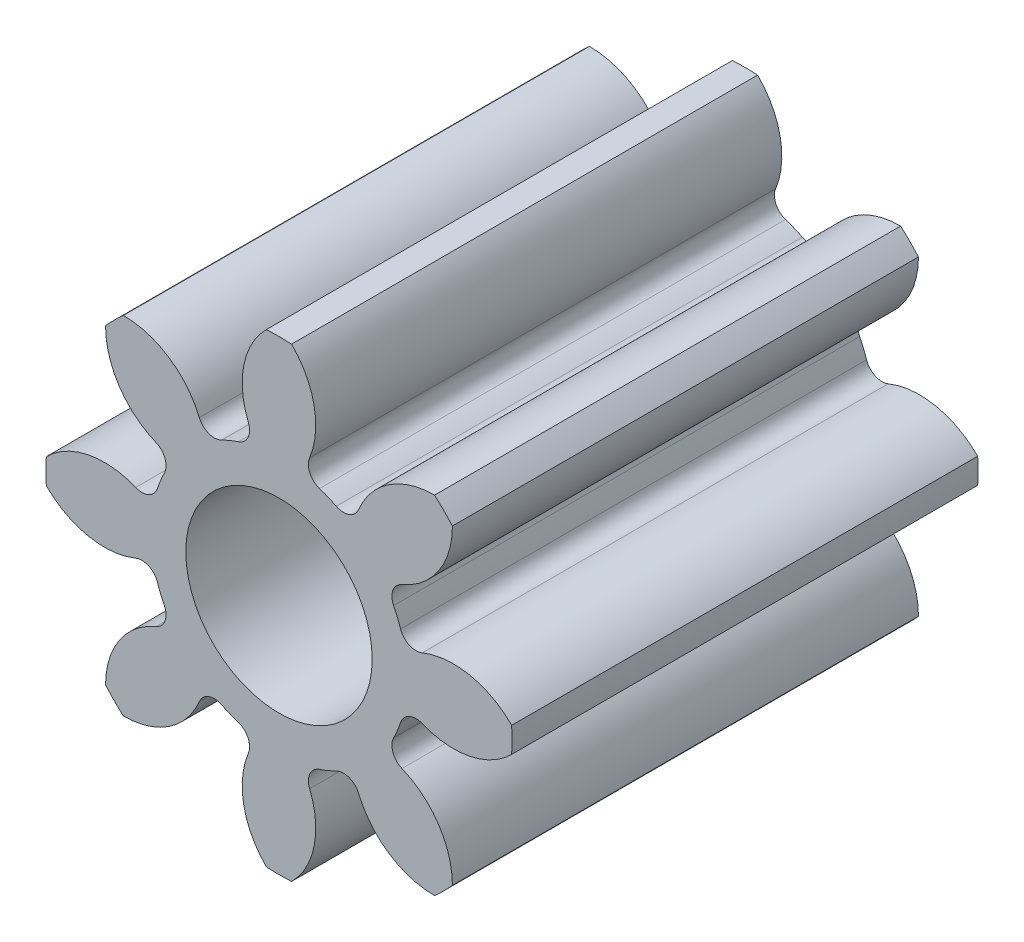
ISO-10303-21;
HEADER;
FILE_DESCRIPTION(('STEP AP214'),'2;1');
FILE_NAME('part.step','',(''),(''),'','','');
FILE_SCHEMA(('AUTOMOTIVE_DESIGN { 1 0 10303 214 1 1 1 1 }'));
ENDSEC;
DATA;
#1=APPLICATION_CONTEXT('core data for automotive mechanical design processes');
#2=APPLICATION_PROTOCOL_DEFINITION('international standard','automotive_design',2000,#1);
#3=PRODUCT_CONTEXT('',#1,'mechanical');
#4=PRODUCT('Part','Part','',(#3));
#5=PRODUCT_RELATED_PRODUCT_CATEGORY('part','',(#4));
#6=PRODUCT_DEFINITION_FORMATION('','',#4);
#7=PRODUCT_DEFINITION_CONTEXT('part definition',#1,'design');
#8=PRODUCT_DEFINITION('design','',#6,#7);
#9=PRODUCT_DEFINITION_SHAPE('','',#8);
#10=(LENGTH_UNIT() NAMED_UNIT(*) SI_UNIT(.MILLI.,.METRE.));
#11=(NAMED_UNIT(*) PLANE_ANGLE_UNIT() SI_UNIT($,.RADIAN.));
#12=(NAMED_UNIT(*) SI_UNIT($,.STERADIAN.) SOLID_ANGLE_UNIT());
#13=UNCERTAINTY_MEASURE_WITH_UNIT(LENGTH_MEASURE(1.E-05),#10,'distance_accuracy_value','');
#14=(GEOMETRIC_REPRESENTATION_CONTEXT(3) GLOBAL_UNCERTAINTY_ASSIGNED_CONTEXT((#13)) GLOBAL_UNIT_ASSIGNED_CONTEXT((#10,
#11,#12)) REPRESENTATION_CONTEXT('',''));
#15=CARTESIAN_POINT('',(0.,0.,0.));
#16=DIRECTION('',(0.,0.,1.));
#17=DIRECTION('',(1.,0.,0.));
#18=AXIS2_PLACEMENT_3D('',#15,#16,#17);
#19=CARTESIAN_POINT('',(-1.37870691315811,-0.560352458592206,5.));
#20=DIRECTION('',(0.,0.,1.));
#21=DIRECTION('',(1.,0.,0.));
#22=AXIS2_PLACEMENT_3D('',#19,#20,#21);
#23=PLANE('',#22);
#24=CARTESIAN_POINT('',(0.288732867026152,0.419550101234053,5.));
#25=DIRECTION('',(0.,0.,1.));
#26=DIRECTION('',(0.707106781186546,-0.707106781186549,0.));
#27=AXIS2_PLACEMENT_3D('',#24,#25,#26);
#28=CIRCLE('',#27,0.880913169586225);
#29=CARTESIAN_POINT('',(0.290836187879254,1.30046075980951,5.));
#30=VERTEX_POINT('',#29);
#31=CARTESIAN_POINT('',(-0.524258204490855,0.758745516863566,5.));
#32=VERTEX_POINT('',#31);
#33=EDGE_CURVE('E510',#30,#32,#28,.T.);
#34=ORIENTED_EDGE('',*,*,#33,.T.);
#35=CARTESIAN_POINT('',(-0.685764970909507,0.826129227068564,5.));
#36=DIRECTION('',(0.,0.,1.));
#37=DIRECTION('',(1.,0.,0.));
#38=AXIS2_PLACEMENT_3D('',#35,#36,#37);
#39=CIRCLE('',#38,0.175);
#40=CARTESIAN_POINT('',(-0.764000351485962,0.669590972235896,5.));
#41=VERTEX_POINT('',#40);
#42=EDGE_CURVE('E586',#32,#41,#39,.F.);
#43=ORIENTED_EDGE('',*,*,#42,.T.);
#44=CARTESIAN_POINT('',(-1.37870691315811,-0.560352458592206,5.));
#45=DIRECTION('',(0.,0.,1.));
#46=DIRECTION('',(1.,0.,0.));
#47=AXIS2_PLACEMENT_3D('',#44,#45,#46);
#48=CIRCLE('',#47,1.375);
#49=CARTESIAN_POINT('',(-0.943668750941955,0.744012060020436,5.));
#50=VERTEX_POINT('',#49);
#51=EDGE_CURVE('E530',#41,#50,#48,.T.);
#52=ORIENTED_EDGE('',*,*,#51,.T.);
#53=CARTESIAN_POINT('',(-0.88830025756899,0.910022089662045,5.));
#54=DIRECTION('',(0.,0.,1.));
#55=DIRECTION('',(1.,0.,0.));
#56=AXIS2_PLACEMENT_3D('',#53,#54,#55);
#57=CIRCLE('',#56,0.175);
#58=CARTESIAN_POINT('',(-1.05015026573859,0.976577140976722,5.));
#59=VERTEX_POINT('',#58);
#60=EDGE_CURVE('E561',#50,#59,#57,.F.);
#61=ORIENTED_EDGE('',*,*,#60,.T.);
#62=CARTESIAN_POINT('',(-1.8648691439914,1.3116012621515,5.));
#63=DIRECTION('',(0.,0.,-1.));
#64=DIRECTION('',(-1.,0.,0.));
#65=AXIS2_PLACEMENT_3D('',#62,#63,#64);
#66=CIRCLE('',#65,0.880913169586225);
#67=CARTESIAN_POINT('',(-1.24345851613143,1.93598643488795,5.));
#68=VERTEX_POINT('',#67);
#69=EDGE_CURVE('E532',#68,#59,#66,.T.);
#70=ORIENTED_EDGE('',*,*,#69,.F.);
#71=CARTESIAN_POINT('',(-1.37870691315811,-0.560352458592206,5.));
#72=DIRECTION('',(0.,0.,1.));
#73=DIRECTION('',(1.,0.,0.));
#74=AXIS2_PLACEMENT_3D('',#71,#72,#73);
#75=CIRCLE('',#74,2.5);
#76=CARTESIAN_POINT('',(-1.51395531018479,1.93598643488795,5.));
#77=VERTEX_POINT('',#76);
#78=EDGE_CURVE('E535',#68,#77,#75,.T.);
#79=ORIENTED_EDGE('',*,*,#78,.T.);
#80=CARTESIAN_POINT('',(-0.89254468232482,1.3116012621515,5.));
#81=DIRECTION('',(0.,0.,1.));
#82=DIRECTION('',(1.,0.,0.));
#83=AXIS2_PLACEMENT_3D('',#80,#81,#82);
#84=CIRCLE('',#83,0.880913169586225);
#85=CARTESIAN_POINT('',(-1.70726356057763,0.976577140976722,5.));
#86=VERTEX_POINT('',#85);
#87=EDGE_CURVE('E537',#77,#86,#84,.T.);
#88=ORIENTED_EDGE('',*,*,#87,.T.);
#89=CARTESIAN_POINT('',(-1.86911356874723,0.910022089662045,5.));
#90=DIRECTION('',(0.,0.,1.));
#91=DIRECTION('',(1.,0.,0.));
#92=AXIS2_PLACEMENT_3D('',#89,#90,#91);
#93=CIRCLE('',#92,0.175);
#94=CARTESIAN_POINT('',(-1.81374507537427,0.744012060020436,5.));
#95=VERTEX_POINT('',#94);
#96=EDGE_CURVE('E565',#86,#95,#93,.F.);
#97=ORIENTED_EDGE('',*,*,#96,.T.);
#98=CARTESIAN_POINT('',(-1.37870691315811,-0.560352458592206,5.));
#99=DIRECTION('',(0.,0.,-1.));
#100=DIRECTION('',(-1.,0.,0.));
#101=AXIS2_PLACEMENT_3D('',#98,#99,#100);
#102=CIRCLE('',#101,1.375);
#103=CARTESIAN_POINT('',(-1.99341347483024,0.669590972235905,5.));
#104=VERTEX_POINT('',#103);
#105=EDGE_CURVE('E540',#104,#95,#102,.T.);
#106=ORIENTED_EDGE('',*,*,#105,.F.);
#107=CARTESIAN_POINT('',(-2.0716488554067,0.826129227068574,5.));
#108=DIRECTION('',(0.,0.,1.));
#109=DIRECTION('',(1.,0.,0.));
#110=AXIS2_PLACEMENT_3D('',#107,#108,#109);
#111=CIRCLE('',#110,0.175);
#112=CARTESIAN_POINT('',(-2.23315562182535,0.758745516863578,5.));
#113=VERTEX_POINT('',#112);
#114=EDGE_CURVE('E697',#104,#113,#111,.F.);
#115=ORIENTED_EDGE('',*,*,#114,.T.);
#116=CARTESIAN_POINT('',(-3.04614669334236,0.419550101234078,5.));
#117=DIRECTION('',(0.,0.,-1.));
#118=DIRECTION('',(-0.707106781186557,-0.707106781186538,0.));
#119=AXIS2_PLACEMENT_3D('',#116,#117,#118);
#120=CIRCLE('',#119,0.880913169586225);
#121=CARTESIAN_POINT('',(-3.04825001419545,1.30046075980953,5.));
#122=VERTEX_POINT('',#121);
#123=EDGE_CURVE('E363',#122,#113,#120,.T.);
#124=ORIENTED_EDGE('',*,*,#123,.F.);
#125=CARTESIAN_POINT('',(-1.37870691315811,-0.560352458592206,5.));
#126=DIRECTION('',(0.,0.,1.));
#127=DIRECTION('',(0.707106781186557,0.707106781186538,0.));
#128=AXIS2_PLACEMENT_3D('',#125,#126,#127);
#129=CIRCLE('',#128,2.5);
#130=CARTESIAN_POINT('',(-3.23952013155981,1.10919064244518,5.));
#131=VERTEX_POINT('',#130);
#132=EDGE_CURVE('E336',#122,#131,#129,.T.);
#133=ORIENTED_EDGE('',*,*,#132,.T.);
#134=CARTESIAN_POINT('',(-2.35860947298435,1.10708732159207,5.));
#135=DIRECTION('',(0.,0.,1.));
#136=DIRECTION('',(0.707106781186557,0.707106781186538,0.));
#137=AXIS2_PLACEMENT_3D('',#134,#135,#136);
#138=CIRCLE('',#137,0.880913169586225);
#139=CARTESIAN_POINT('',(-2.69780488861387,0.294096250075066,5.));
#140=VERTEX_POINT('',#139);
#141=EDGE_CURVE('E366',#131,#140,#138,.T.);
#142=ORIENTED_EDGE('',*,*,#141,.T.);
#143=CARTESIAN_POINT('',(-2.76518859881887,0.132589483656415,5.));
#144=DIRECTION('',(0.,0.,1.));
#145=DIRECTION('',(1.,0.,0.));
#146=AXIS2_PLACEMENT_3D('',#143,#144,#145);
#147=CIRCLE('',#146,0.175);
#148=CARTESIAN_POINT('',(-2.60865034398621,0.0543541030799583,5.));
#149=VERTEX_POINT('',#148);
#150=EDGE_CURVE('E11',#140,#149,#147,.F.);
#151=ORIENTED_EDGE('',*,*,#150,.T.);
#152=CARTESIAN_POINT('',(-1.37870691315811,-0.560352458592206,5.));
#153=DIRECTION('',(0.,0.,1.));
#154=DIRECTION('',(0.,1.,0.));
#155=AXIS2_PLACEMENT_3D('',#152,#153,#154);
#156=CIRCLE('',#155,1.375);
#157=CARTESIAN_POINT('',(-2.68307143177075,-0.125314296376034,5.));
#158=VERTEX_POINT('',#157);
#159=EDGE_CURVE('E378',#149,#158,#156,.T.);
#160=ORIENTED_EDGE('',*,*,#159,.T.);
#161=CARTESIAN_POINT('',(-2.84908146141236,-0.069945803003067,5.));
#162=DIRECTION('',(0.,0.,1.));
#163=DIRECTION('',(1.,0.,0.));
#164=AXIS2_PLACEMENT_3D('',#161,#162,#163);
#165=CIRCLE('',#164,0.175);
#166=CARTESIAN_POINT('',(-2.91563651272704,-0.23179581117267,5.));
#167=VERTEX_POINT('',#166);
#168=EDGE_CURVE('E682',#158,#167,#165,.F.);
#169=ORIENTED_EDGE('',*,*,#168,.T.);
#170=CARTESIAN_POINT('',(-3.25066063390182,-1.04651468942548,5.));
#171=DIRECTION('',(0.,0.,-1.));
#172=DIRECTION('',(0.,-1.,0.));
#173=AXIS2_PLACEMENT_3D('',#170,#171,#172);
#174=CIRCLE('',#173,0.880913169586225);
#175=CARTESIAN_POINT('',(-3.87504580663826,-0.425104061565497,5.));
#176=VERTEX_POINT('',#175);
#177=EDGE_CURVE('E380',#176,#167,#174,.T.);
#178=ORIENTED_EDGE('',*,*,#177,.F.);
#179=CARTESIAN_POINT('',(-1.37870691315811,-0.560352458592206,5.));
#180=DIRECTION('',(0.,0.,1.));
#181=DIRECTION('',(0.,1.,0.));
#182=AXIS2_PLACEMENT_3D('',#179,#180,#181);
#183=CIRCLE('',#182,2.5);
#184=CARTESIAN_POINT('',(-3.87504580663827,-0.695600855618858,5.));
#185=VERTEX_POINT('',#184);
#186=EDGE_CURVE('E383',#176,#185,#183,.T.);
#187=ORIENTED_EDGE('',*,*,#186,.T.);
#188=CARTESIAN_POINT('',(-3.25066063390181,-0.0741902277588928,5.));
#189=DIRECTION('',(0.,0.,1.));
#190=DIRECTION('',(0.,1.,0.));
#191=AXIS2_PLACEMENT_3D('',#188,#189,#190);
#192=CIRCLE('',#191,0.880913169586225);
#193=CARTESIAN_POINT('',(-2.91563651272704,-0.888909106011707,5.));
#194=VERTEX_POINT('',#193);
#195=EDGE_CURVE('E385',#185,#194,#192,.T.);
#196=ORIENTED_EDGE('',*,*,#195,.T.);
#197=CARTESIAN_POINT('',(-2.84908146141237,-1.05075911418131,5.));
#198=DIRECTION('',(0.,0.,1.));
#199=DIRECTION('',(1.,0.,0.));
#200=AXIS2_PLACEMENT_3D('',#197,#198,#199);
#201=CIRCLE('',#200,0.175);
#202=CARTESIAN_POINT('',(-2.68307143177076,-0.995390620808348,5.));
#203=VERTEX_POINT('',#202);
#204=EDGE_CURVE('E686',#194,#203,#201,.F.);
#205=ORIENTED_EDGE('',*,*,#204,.T.);
#206=CARTESIAN_POINT('',(-1.37870691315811,-0.560352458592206,5.));
#207=DIRECTION('',(0.,0.,1.));
#208=DIRECTION('',(-0.707106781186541,0.707106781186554,0.));
#209=AXIS2_PLACEMENT_3D('',#206,#207,#208);
#210=CIRCLE('',#209,1.375);
#211=CARTESIAN_POINT('',(-2.60865034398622,-1.17505902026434,5.));
#212=VERTEX_POINT('',#211);
#213=EDGE_CURVE('E403',#203,#212,#210,.T.);
#214=ORIENTED_EDGE('',*,*,#213,.T.);
#215=CARTESIAN_POINT('',(-2.76518859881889,-1.2532944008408,5.));
#216=DIRECTION('',(0.,0.,1.));
#217=DIRECTION('',(1.,0.,0.));
#218=AXIS2_PLACEMENT_3D('',#215,#216,#217);
#219=CIRCLE('',#218,0.175);
#220=CARTESIAN_POINT('',(-2.69780488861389,-1.41480116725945,5.));
#221=VERTEX_POINT('',#220);
#222=EDGE_CURVE('E662',#212,#221,#219,.F.);
#223=ORIENTED_EDGE('',*,*,#222,.T.);
#224=CARTESIAN_POINT('',(-2.35860947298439,-2.22779223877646,5.));
#225=DIRECTION('',(0.,0.,-1.));
#226=DIRECTION('',(0.707106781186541,-0.707106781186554,0.));
#227=AXIS2_PLACEMENT_3D('',#224,#225,#226);
#228=CIRCLE('',#227,0.880913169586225);
#229=CARTESIAN_POINT('',(-3.23952013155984,-2.22989555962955,5.));
#230=VERTEX_POINT('',#229);
#231=EDGE_CURVE('E405',#230,#221,#228,.T.);
#232=ORIENTED_EDGE('',*,*,#231,.F.);
#233=CARTESIAN_POINT('',(-1.37870691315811,-0.560352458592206,5.));
#234=DIRECTION('',(0.,0.,1.));
#235=DIRECTION('',(-0.707106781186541,0.707106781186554,0.));
#236=AXIS2_PLACEMENT_3D('',#233,#234,#235);
#237=CIRCLE('',#236,2.5);
#238=CARTESIAN_POINT('',(-3.04825001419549,-2.42116567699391,5.));
#239=VERTEX_POINT('',#238);
#240=EDGE_CURVE('E408',#230,#239,#237,.T.);
#241=ORIENTED_EDGE('',*,*,#240,.T.);
#242=CARTESIAN_POINT('',(-3.04614669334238,-1.54025501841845,5.));
#243=DIRECTION('',(0.,0.,1.));
#244=DIRECTION('',(-0.707106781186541,0.707106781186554,0.));
#245=AXIS2_PLACEMENT_3D('',#242,#243,#244);
#246=CIRCLE('',#245,0.880913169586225);
#247=CARTESIAN_POINT('',(-2.23315562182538,-1.87945043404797,5.));
#248=VERTEX_POINT('',#247);
#249=EDGE_CURVE('E410',#239,#248,#246,.T.);
#250=ORIENTED_EDGE('',*,*,#249,.T.);
#251=CARTESIAN_POINT('',(-2.07164885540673,-1.94683414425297,5.));
#252=DIRECTION('',(0.,0.,1.));
#253=DIRECTION('',(1.,0.,0.));
#254=AXIS2_PLACEMENT_3D('',#251,#252,#253);
#255=CIRCLE('',#254,0.175);
#256=CARTESIAN_POINT('',(-1.99341347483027,-1.7902958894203,5.));
#257=VERTEX_POINT('',#256);
#258=EDGE_CURVE('E666',#248,#257,#255,.F.);
#259=ORIENTED_EDGE('',*,*,#258,.T.);
#260=CARTESIAN_POINT('',(-1.37870691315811,-0.560352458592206,5.));
#261=DIRECTION('',(0.,0.,1.));
#262=DIRECTION('',(-1.,0.,0.));
#263=AXIS2_PLACEMENT_3D('',#260,#261,#262);
#264=CIRCLE('',#263,1.375);
#265=CARTESIAN_POINT('',(-1.81374507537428,-1.86471697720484,5.));
#266=VERTEX_POINT('',#265);
#267=EDGE_CURVE('E428',#257,#266,#264,.T.);
#268=ORIENTED_EDGE('',*,*,#267,.T.);
#269=CARTESIAN_POINT('',(-1.86911356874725,-2.03072700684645,5.));
#270=DIRECTION('',(0.,0.,1.));
#271=DIRECTION('',(1.,0.,0.));
#272=AXIS2_PLACEMENT_3D('',#269,#270,#271);
#273=CIRCLE('',#272,0.175);
#274=CARTESIAN_POINT('',(-1.70726356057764,-2.09728205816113,5.));
#275=VERTEX_POINT('',#274);
#276=EDGE_CURVE('E642',#266,#275,#273,.F.);
#277=ORIENTED_EDGE('',*,*,#276,.T.);
#278=CARTESIAN_POINT('',(-0.892544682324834,-2.43230617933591,5.));
#279=DIRECTION('',(0.,0.,-1.));
#280=DIRECTION('',(1.,0.,0.));
#281=AXIS2_PLACEMENT_3D('',#278,#279,#280);
#282=CIRCLE('',#281,0.880913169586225);
#283=CARTESIAN_POINT('',(-1.51395531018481,-3.05669135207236,5.));
#284=VERTEX_POINT('',#283);
#285=EDGE_CURVE('E430',#284,#275,#282,.T.);
#286=ORIENTED_EDGE('',*,*,#285,.F.);
#287=CARTESIAN_POINT('',(-1.37870691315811,-0.560352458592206,5.));
#288=DIRECTION('',(0.,0.,1.));
#289=DIRECTION('',(-1.,0.,0.));
#290=AXIS2_PLACEMENT_3D('',#287,#288,#289);
#291=CIRCLE('',#290,2.5);
#292=CARTESIAN_POINT('',(-1.24345851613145,-3.05669135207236,5.));
#293=VERTEX_POINT('',#292);
#294=EDGE_CURVE('E433',#284,#293,#291,.T.);
#295=ORIENTED_EDGE('',*,*,#294,.T.);
#296=CARTESIAN_POINT('',(-1.86486914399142,-2.43230617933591,5.));
#297=DIRECTION('',(0.,0.,1.));
#298=DIRECTION('',(-1.,0.,0.));
#299=AXIS2_PLACEMENT_3D('',#296,#297,#298);
#300=CIRCLE('',#299,0.880913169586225);
#301=CARTESIAN_POINT('',(-1.0501502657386,-2.09728205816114,5.));
#302=VERTEX_POINT('',#301);
#303=EDGE_CURVE('E435',#293,#302,#300,.T.);
#304=ORIENTED_EDGE('',*,*,#303,.T.);
#305=CARTESIAN_POINT('',(-0.888300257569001,-2.03072700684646,5.));
#306=DIRECTION('',(0.,0.,1.));
#307=DIRECTION('',(1.,0.,0.));
#308=AXIS2_PLACEMENT_3D('',#305,#306,#307);
#309=CIRCLE('',#308,0.175);
#310=CARTESIAN_POINT('',(-0.943668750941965,-1.86471697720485,5.));
#311=VERTEX_POINT('',#310);
#312=EDGE_CURVE('E646',#302,#311,#309,.F.);
#313=ORIENTED_EDGE('',*,*,#312,.T.);
#314=CARTESIAN_POINT('',(-1.37870691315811,-0.560352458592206,5.));
#315=DIRECTION('',(0.,0.,1.));
#316=DIRECTION('',(-0.707106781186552,-0.707106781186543,0.));
#317=AXIS2_PLACEMENT_3D('',#314,#315,#316);
#318=CIRCLE('',#317,1.375);
#319=CARTESIAN_POINT('',(-0.764000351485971,-1.79029588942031,5.));
#320=VERTEX_POINT('',#319);
#321=EDGE_CURVE('E453',#311,#320,#318,.T.);
#322=ORIENTED_EDGE('',*,*,#321,.T.);
#323=CARTESIAN_POINT('',(-0.685764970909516,-1.94683414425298,5.));
#324=DIRECTION('',(0.,0.,1.));
#325=DIRECTION('',(1.,0.,0.));
#326=AXIS2_PLACEMENT_3D('',#323,#324,#325);
#327=CIRCLE('',#326,0.175);
#328=CARTESIAN_POINT('',(-0.524258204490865,-1.87945043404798,5.));
#329=VERTEX_POINT('',#328);
#330=EDGE_CURVE('E622',#320,#329,#327,.F.);
#331=ORIENTED_EDGE('',*,*,#330,.T.);
#332=CARTESIAN_POINT('',(0.288732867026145,-1.54025501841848,5.));
#333=DIRECTION('',(0.,0.,-1.));
#334=DIRECTION('',(0.707106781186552,0.707106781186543,0.));
#335=AXIS2_PLACEMENT_3D('',#332,#333,#334);
#336=CIRCLE('',#335,0.880913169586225);
#337=CARTESIAN_POINT('',(0.29083618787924,-2.42116567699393,5.));
#338=VERTEX_POINT('',#337);
#339=EDGE_CURVE('E455',#338,#329,#336,.T.);
#340=ORIENTED_EDGE('',*,*,#339,.F.);
#341=CARTESIAN_POINT('',(-1.37870691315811,-0.560352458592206,5.));
#342=DIRECTION('',(0.,0.,1.));
#343=DIRECTION('',(-0.707106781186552,-0.707106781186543,0.));
#344=AXIS2_PLACEMENT_3D('',#341,#342,#343);
#345=CIRCLE('',#344,2.5);
#346=CARTESIAN_POINT('',(0.482106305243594,-2.22989555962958,5.));
#347=VERTEX_POINT('',#346);
#348=EDGE_CURVE('E458',#338,#347,#345,.T.);
#349=ORIENTED_EDGE('',*,*,#348,.T.);
#350=CARTESIAN_POINT('',(-0.39880435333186,-2.22779223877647,5.));
#351=DIRECTION('',(0.,0.,1.));
#352=DIRECTION('',(-0.707106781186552,-0.707106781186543,0.));
#353=AXIS2_PLACEMENT_3D('',#350,#351,#352);
#354=CIRCLE('',#353,0.880913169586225);
#355=CARTESIAN_POINT('',(-0.0596089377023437,-1.41480116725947,5.));
#356=VERTEX_POINT('',#355);
#357=EDGE_CURVE('E460',#347,#356,#354,.T.);
#358=ORIENTED_EDGE('',*,*,#357,.T.);
#359=CARTESIAN_POINT('',(0.00777477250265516,-1.25329440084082,5.));
#360=DIRECTION('',(0.,0.,1.));
#361=DIRECTION('',(1.,0.,0.));
#362=AXIS2_PLACEMENT_3D('',#359,#360,#361);
#363=CIRCLE('',#362,0.175);
#364=CARTESIAN_POINT('',(-0.148763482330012,-1.17505902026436,5.));
#365=VERTEX_POINT('',#364);
#366=EDGE_CURVE('E626',#356,#365,#363,.F.);
#367=ORIENTED_EDGE('',*,*,#366,.T.);
#368=CARTESIAN_POINT('',(-1.37870691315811,-0.560352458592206,5.));
#369=DIRECTION('',(0.,0.,1.));
#370=DIRECTION('',(0.,-1.,0.));
#371=AXIS2_PLACEMENT_3D('',#368,#369,#370);
#372=CIRCLE('',#371,1.375);
#373=CARTESIAN_POINT('',(-0.0743423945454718,-0.995390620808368,5.));
#374=VERTEX_POINT('',#373);
#375=EDGE_CURVE('E478',#365,#374,#372,.T.);
#376=ORIENTED_EDGE('',*,*,#375,.T.);
#377=CARTESIAN_POINT('',(0.091667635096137,-1.05075911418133,5.));
#378=DIRECTION('',(0.,0.,1.));
#379=DIRECTION('',(1.,0.,0.));
#380=AXIS2_PLACEMENT_3D('',#377,#378,#379);
#381=CIRCLE('',#380,0.175);
#382=CARTESIAN_POINT('',(0.158222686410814,-0.888909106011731,5.));
#383=VERTEX_POINT('',#382);
#384=EDGE_CURVE('E602',#374,#383,#381,.F.);
#385=ORIENTED_EDGE('',*,*,#384,.T.);
#386=CARTESIAN_POINT('',(0.493246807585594,-0.0741902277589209,5.));
#387=DIRECTION('',(0.,0.,-1.));
#388=DIRECTION('',(0.,1.,0.));
#389=AXIS2_PLACEMENT_3D('',#386,#387,#388);
#390=CIRCLE('',#389,0.880913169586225);
#391=CARTESIAN_POINT('',(1.11763198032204,-0.695600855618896,5.));
#392=VERTEX_POINT('',#391);
#393=EDGE_CURVE('E480',#392,#383,#390,.T.);
#394=ORIENTED_EDGE('',*,*,#393,.F.);
#395=CARTESIAN_POINT('',(-1.37870691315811,-0.560352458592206,5.));
#396=DIRECTION('',(0.,0.,1.));
#397=DIRECTION('',(0.,-1.,0.));
#398=AXIS2_PLACEMENT_3D('',#395,#396,#397);
#399=CIRCLE('',#398,2.5);
#400=CARTESIAN_POINT('',(1.11763198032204,-0.425104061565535,5.));
#401=VERTEX_POINT('',#400);
#402=EDGE_CURVE('E483',#392,#401,#399,.T.);
#403=ORIENTED_EDGE('',*,*,#402,.T.);
#404=CARTESIAN_POINT('',(0.49324680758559,-1.04651468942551,5.));
#405=DIRECTION('',(0.,0.,1.));
#406=DIRECTION('',(0.,-1.,0.));
#407=AXIS2_PLACEMENT_3D('',#404,#405,#406);
#408=CIRCLE('',#407,0.880913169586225);
#409=CARTESIAN_POINT('',(0.158222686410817,-0.231795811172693,5.));
#410=VERTEX_POINT('',#409);
#411=EDGE_CURVE('E485',#401,#410,#408,.T.);
#412=ORIENTED_EDGE('',*,*,#411,.T.);
#413=CARTESIAN_POINT('',(0.0916676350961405,-0.0699458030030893,5.));
#414=DIRECTION('',(0.,0.,1.));
#415=DIRECTION('',(1.,0.,0.));
#416=AXIS2_PLACEMENT_3D('',#413,#414,#415);
#417=CIRCLE('',#416,0.175);
#418=CARTESIAN_POINT('',(-0.0743423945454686,-0.125314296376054,5.));
#419=VERTEX_POINT('',#418);
#420=EDGE_CURVE('E606',#410,#419,#417,.F.);
#421=ORIENTED_EDGE('',*,*,#420,.T.);
#422=CARTESIAN_POINT('',(-1.37870691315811,-0.560352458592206,5.));
#423=DIRECTION('',(0.,0.,1.));
#424=DIRECTION('',(0.707106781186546,-0.707106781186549,0.));
#425=AXIS2_PLACEMENT_3D('',#422,#423,#424);
#426=CIRCLE('',#425,1.375);
#427=CARTESIAN_POINT('',(-0.148763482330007,0.0543541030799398,5.));
#428=VERTEX_POINT('',#427);
#429=EDGE_CURVE('E503',#419,#428,#426,.T.);
#430=ORIENTED_EDGE('',*,*,#429,.T.);
#431=CARTESIAN_POINT('',(0.00777477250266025,0.132589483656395,5.));
#432=DIRECTION('',(0.,0.,1.));
#433=DIRECTION('',(1.,0.,0.));
#434=AXIS2_PLACEMENT_3D('',#431,#432,#433);
#435=CIRCLE('',#434,0.175);
#436=CARTESIAN_POINT('',(-0.0596089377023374,0.294096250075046,5.));
#437=VERTEX_POINT('',#436);
#438=EDGE_CURVE('E582',#428,#437,#435,.F.);
#439=ORIENTED_EDGE('',*,*,#438,.T.);
#440=CARTESIAN_POINT('',(-0.398804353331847,1.10708732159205,5.));
#441=DIRECTION('',(0.,0.,-1.));
#442=DIRECTION('',(-0.707106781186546,0.707106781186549,0.));
#443=AXIS2_PLACEMENT_3D('',#440,#441,#442);
#444=CIRCLE('',#443,0.880913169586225);
#445=CARTESIAN_POINT('',(0.482106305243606,1.10919064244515,5.));
#446=VERTEX_POINT('',#445);
#447=EDGE_CURVE('E505',#446,#437,#444,.T.);
#448=ORIENTED_EDGE('',*,*,#447,.F.);
#449=CARTESIAN_POINT('',(-1.37870691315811,-0.560352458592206,5.));
#450=DIRECTION('',(0.,0.,1.));
#451=DIRECTION('',(0.707106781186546,-0.707106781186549,0.));
#452=AXIS2_PLACEMENT_3D('',#449,#450,#451);
#453=CIRCLE('',#452,2.5);
#454=EDGE_CURVE('E508',#446,#30,#453,.T.);
#455=ORIENTED_EDGE('',*,*,#454,.T.);
#456=EDGE_LOOP('',(#34,#43,#52,#61,#70,#79,#88,#97,#106,#115,#124,#133,#142,#151,#160,#169,#178,
#187,#196,#205,#214,#223,#232,#241,#250,#259,#268,#277,#286,#295,#304,#313,#322,#331,#340,#349,
#358,#367,#376,#385,#394,#403,#412,#421,#430,#439,#448,#455));
#457=FACE_BOUND('',#456,.T.);
#458=CARTESIAN_POINT('',(-1.37870691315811,-0.560352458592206,5.));
#459=DIRECTION('',(0.,0.,1.));
#460=DIRECTION('',(1.,0.,0.));
#461=AXIS2_PLACEMENT_3D('',#458,#459,#460);
#462=CIRCLE('',#461,1.);
#463=CARTESIAN_POINT('',(-0.378706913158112,-0.560352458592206,5.));
#464=VERTEX_POINT('',#463);
#465=EDGE_CURVE('E355',#464,#464,#462,.T.);
#466=ORIENTED_EDGE('',*,*,#465,.F.);
#467=EDGE_LOOP('',(#466));
#468=FACE_BOUND('',#467,.T.);
#469=ADVANCED_FACE('F26',(#457,#468),#23,.T.);
#470=CARTESIAN_POINT('',(-1.37870691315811,-0.560352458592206,0.));
#471=DIRECTION('',(0.,0.,1.));
#472=DIRECTION('',(1.,0.,0.));
#473=AXIS2_PLACEMENT_3D('',#470,#471,#472);
#474=PLANE('',#473);
#475=CARTESIAN_POINT('',(-1.37870691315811,-0.560352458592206,0.));
#476=DIRECTION('',(0.,0.,1.));
#477=DIRECTION('',(1.,0.,0.));
#478=AXIS2_PLACEMENT_3D('',#475,#476,#477);
#479=CIRCLE('',#478,1.375);
#480=CARTESIAN_POINT('',(-0.764000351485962,0.669590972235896,0.));
#481=VERTEX_POINT('',#480);
#482=CARTESIAN_POINT('',(-0.943668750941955,0.744012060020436,0.));
#483=VERTEX_POINT('',#482);
#484=EDGE_CURVE('E518',#481,#483,#479,.T.);
#485=ORIENTED_EDGE('',*,*,#484,.F.);
#486=CARTESIAN_POINT('',(-0.685764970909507,0.826129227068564,0.));
#487=DIRECTION('',(0.,0.,1.));
#488=DIRECTION('',(1.,0.,0.));
#489=AXIS2_PLACEMENT_3D('',#486,#487,#488);
#490=CIRCLE('',#489,0.175);
#491=CARTESIAN_POINT('',(-0.524258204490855,0.758745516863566,0.));
#492=VERTEX_POINT('',#491);
#493=EDGE_CURVE('E584',#481,#492,#490,.T.);
#494=ORIENTED_EDGE('',*,*,#493,.T.);
#495=CARTESIAN_POINT('',(0.288732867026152,0.419550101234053,0.));
#496=DIRECTION('',(0.,0.,1.));
#497=DIRECTION('',(0.707106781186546,-0.707106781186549,0.));
#498=AXIS2_PLACEMENT_3D('',#495,#496,#497);
#499=CIRCLE('',#498,0.880913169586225);
#500=CARTESIAN_POINT('',(0.290836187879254,1.30046075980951,0.));
#501=VERTEX_POINT('',#500);
#502=EDGE_CURVE('E500',#501,#492,#499,.T.);
#503=ORIENTED_EDGE('',*,*,#502,.F.);
#504=CARTESIAN_POINT('',(-1.37870691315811,-0.560352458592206,0.));
#505=DIRECTION('',(0.,0.,1.));
#506=DIRECTION('',(0.707106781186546,-0.707106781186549,0.));
#507=AXIS2_PLACEMENT_3D('',#504,#505,#506);
#508=CIRCLE('',#507,2.5);
#509=CARTESIAN_POINT('',(0.482106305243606,1.10919064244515,0.));
#510=VERTEX_POINT('',#509);
#511=EDGE_CURVE('E498',#510,#501,#508,.T.);
#512=ORIENTED_EDGE('',*,*,#511,.F.);
#513=CARTESIAN_POINT('',(-0.398804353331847,1.10708732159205,0.));
#514=DIRECTION('',(0.,0.,-1.));
#515=DIRECTION('',(-0.707106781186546,0.707106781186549,0.));
#516=AXIS2_PLACEMENT_3D('',#513,#514,#515);
#517=CIRCLE('',#516,0.880913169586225);
#518=CARTESIAN_POINT('',(-0.0596089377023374,0.294096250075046,0.));
#519=VERTEX_POINT('',#518);
#520=EDGE_CURVE('E495',#510,#519,#517,.T.);
#521=ORIENTED_EDGE('',*,*,#520,.T.);
#522=CARTESIAN_POINT('',(0.00777477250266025,0.132589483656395,0.));
#523=DIRECTION('',(0.,0.,1.));
#524=DIRECTION('',(1.,0.,0.));
#525=AXIS2_PLACEMENT_3D('',#522,#523,#524);
#526=CIRCLE('',#525,0.175);
#527=CARTESIAN_POINT('',(-0.148763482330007,0.0543541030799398,0.));
#528=VERTEX_POINT('',#527);
#529=EDGE_CURVE('E579',#519,#528,#526,.T.);
#530=ORIENTED_EDGE('',*,*,#529,.T.);
#531=CARTESIAN_POINT('',(-1.37870691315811,-0.560352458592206,0.));
#532=DIRECTION('',(0.,0.,1.));
#533=DIRECTION('',(0.707106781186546,-0.707106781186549,0.));
#534=AXIS2_PLACEMENT_3D('',#531,#532,#533);
#535=CIRCLE('',#534,1.375);
#536=CARTESIAN_POINT('',(-0.0743423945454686,-0.125314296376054,0.));
#537=VERTEX_POINT('',#536);
#538=EDGE_CURVE('E493',#537,#528,#535,.T.);
#539=ORIENTED_EDGE('',*,*,#538,.F.);
#540=CARTESIAN_POINT('',(0.0916676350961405,-0.0699458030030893,0.));
#541=DIRECTION('',(0.,0.,1.));
#542=DIRECTION('',(1.,0.,0.));
#543=AXIS2_PLACEMENT_3D('',#540,#541,#542);
#544=CIRCLE('',#543,0.175);
#545=CARTESIAN_POINT('',(0.158222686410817,-0.231795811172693,0.));
#546=VERTEX_POINT('',#545);
#547=EDGE_CURVE('E604',#537,#546,#544,.T.);
#548=ORIENTED_EDGE('',*,*,#547,.T.);
#549=CARTESIAN_POINT('',(0.49324680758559,-1.04651468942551,0.));
#550=DIRECTION('',(0.,0.,1.));
#551=DIRECTION('',(0.,-1.,0.));
#552=AXIS2_PLACEMENT_3D('',#549,#550,#551);
#553=CIRCLE('',#552,0.880913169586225);
#554=CARTESIAN_POINT('',(1.11763198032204,-0.425104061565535,0.));
#555=VERTEX_POINT('',#554);
#556=EDGE_CURVE('E475',#555,#546,#553,.T.);
#557=ORIENTED_EDGE('',*,*,#556,.F.);
#558=CARTESIAN_POINT('',(-1.37870691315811,-0.560352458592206,0.));
#559=DIRECTION('',(0.,0.,1.));
#560=DIRECTION('',(0.,-1.,0.));
#561=AXIS2_PLACEMENT_3D('',#558,#559,#560);
#562=CIRCLE('',#561,2.5);
#563=CARTESIAN_POINT('',(1.11763198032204,-0.695600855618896,0.));
#564=VERTEX_POINT('',#563);
#565=EDGE_CURVE('E473',#564,#555,#562,.T.);
#566=ORIENTED_EDGE('',*,*,#565,.F.);
#567=CARTESIAN_POINT('',(0.493246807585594,-0.0741902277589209,0.));
#568=DIRECTION('',(0.,0.,-1.));
#569=DIRECTION('',(0.,1.,0.));
#570=AXIS2_PLACEMENT_3D('',#567,#568,#569);
#571=CIRCLE('',#570,0.880913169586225);
#572=CARTESIAN_POINT('',(0.158222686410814,-0.888909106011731,0.));
#573=VERTEX_POINT('',#572);
#574=EDGE_CURVE('E470',#564,#573,#571,.T.);
#575=ORIENTED_EDGE('',*,*,#574,.T.);
#576=CARTESIAN_POINT('',(0.091667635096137,-1.05075911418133,0.));
#577=DIRECTION('',(0.,0.,1.));
#578=DIRECTION('',(1.,0.,0.));
#579=AXIS2_PLACEMENT_3D('',#576,#577,#578);
#580=CIRCLE('',#579,0.175);
#581=CARTESIAN_POINT('',(-0.0743423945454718,-0.995390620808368,0.));
#582=VERTEX_POINT('',#581);
#583=EDGE_CURVE('E599',#573,#582,#580,.T.);
#584=ORIENTED_EDGE('',*,*,#583,.T.);
#585=CARTESIAN_POINT('',(-1.37870691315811,-0.560352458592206,0.));
#586=DIRECTION('',(0.,0.,1.));
#587=DIRECTION('',(0.,-1.,0.));
#588=AXIS2_PLACEMENT_3D('',#585,#586,#587);
#589=CIRCLE('',#588,1.375);
#590=CARTESIAN_POINT('',(-0.148763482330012,-1.17505902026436,0.));
#591=VERTEX_POINT('',#590);
#592=EDGE_CURVE('E468',#591,#582,#589,.T.);
#593=ORIENTED_EDGE('',*,*,#592,.F.);
#594=CARTESIAN_POINT('',(0.00777477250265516,-1.25329440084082,0.));
#595=DIRECTION('',(0.,0.,1.));
#596=DIRECTION('',(1.,0.,0.));
#597=AXIS2_PLACEMENT_3D('',#594,#595,#596);
#598=CIRCLE('',#597,0.175);
#599=CARTESIAN_POINT('',(-0.0596089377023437,-1.41480116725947,0.));
#600=VERTEX_POINT('',#599);
#601=EDGE_CURVE('E624',#591,#600,#598,.T.);
#602=ORIENTED_EDGE('',*,*,#601,.T.);
#603=CARTESIAN_POINT('',(-0.39880435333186,-2.22779223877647,0.));
#604=DIRECTION('',(0.,0.,1.));
#605=DIRECTION('',(-0.707106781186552,-0.707106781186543,0.));
#606=AXIS2_PLACEMENT_3D('',#603,#604,#605);
#607=CIRCLE('',#606,0.880913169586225);
#608=CARTESIAN_POINT('',(0.482106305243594,-2.22989555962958,0.));
#609=VERTEX_POINT('',#608);
#610=EDGE_CURVE('E450',#609,#600,#607,.T.);
#611=ORIENTED_EDGE('',*,*,#610,.F.);
#612=CARTESIAN_POINT('',(-1.37870691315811,-0.560352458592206,0.));
#613=DIRECTION('',(0.,0.,1.));
#614=DIRECTION('',(-0.707106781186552,-0.707106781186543,0.));
#615=AXIS2_PLACEMENT_3D('',#612,#613,#614);
#616=CIRCLE('',#615,2.5);
#617=CARTESIAN_POINT('',(0.29083618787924,-2.42116567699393,0.));
#618=VERTEX_POINT('',#617);
#619=EDGE_CURVE('E448',#618,#609,#616,.T.);
#620=ORIENTED_EDGE('',*,*,#619,.F.);
#621=CARTESIAN_POINT('',(0.288732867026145,-1.54025501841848,0.));
#622=DIRECTION('',(0.,0.,-1.));
#623=DIRECTION('',(0.707106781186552,0.707106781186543,0.));
#624=AXIS2_PLACEMENT_3D('',#621,#622,#623);
#625=CIRCLE('',#624,0.880913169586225);
#626=CARTESIAN_POINT('',(-0.524258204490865,-1.87945043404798,0.));
#627=VERTEX_POINT('',#626);
#628=EDGE_CURVE('E445',#618,#627,#625,.T.);
#629=ORIENTED_EDGE('',*,*,#628,.T.);
#630=CARTESIAN_POINT('',(-0.685764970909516,-1.94683414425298,0.));
#631=DIRECTION('',(0.,0.,1.));
#632=DIRECTION('',(1.,0.,0.));
#633=AXIS2_PLACEMENT_3D('',#630,#631,#632);
#634=CIRCLE('',#633,0.175);
#635=CARTESIAN_POINT('',(-0.764000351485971,-1.79029588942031,0.));
#636=VERTEX_POINT('',#635);
#637=EDGE_CURVE('E619',#627,#636,#634,.T.);
#638=ORIENTED_EDGE('',*,*,#637,.T.);
#639=CARTESIAN_POINT('',(-1.37870691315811,-0.560352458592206,0.));
#640=DIRECTION('',(0.,0.,1.));
#641=DIRECTION('',(-0.707106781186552,-0.707106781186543,0.));
#642=AXIS2_PLACEMENT_3D('',#639,#640,#641);
#643=CIRCLE('',#642,1.375);
#644=CARTESIAN_POINT('',(-0.943668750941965,-1.86471697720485,0.));
#645=VERTEX_POINT('',#644);
#646=EDGE_CURVE('E443',#645,#636,#643,.T.);
#647=ORIENTED_EDGE('',*,*,#646,.F.);
#648=CARTESIAN_POINT('',(-0.888300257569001,-2.03072700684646,0.));
#649=DIRECTION('',(0.,0.,1.));
#650=DIRECTION('',(1.,0.,0.));
#651=AXIS2_PLACEMENT_3D('',#648,#649,#650);
#652=CIRCLE('',#651,0.175);
#653=CARTESIAN_POINT('',(-1.0501502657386,-2.09728205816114,0.));
#654=VERTEX_POINT('',#653);
#655=EDGE_CURVE('E644',#645,#654,#652,.T.);
#656=ORIENTED_EDGE('',*,*,#655,.T.);
#657=CARTESIAN_POINT('',(-1.86486914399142,-2.43230617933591,0.));
#658=DIRECTION('',(0.,0.,1.));
#659=DIRECTION('',(-1.,0.,0.));
#660=AXIS2_PLACEMENT_3D('',#657,#658,#659);
#661=CIRCLE('',#660,0.880913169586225);
#662=CARTESIAN_POINT('',(-1.24345851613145,-3.05669135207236,0.));
#663=VERTEX_POINT('',#662);
#664=EDGE_CURVE('E425',#663,#654,#661,.T.);
#665=ORIENTED_EDGE('',*,*,#664,.F.);
#666=CARTESIAN_POINT('',(-1.37870691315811,-0.560352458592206,0.));
#667=DIRECTION('',(0.,0.,1.));
#668=DIRECTION('',(-1.,0.,0.));
#669=AXIS2_PLACEMENT_3D('',#666,#667,#668);
#670=CIRCLE('',#669,2.5);
#671=CARTESIAN_POINT('',(-1.51395531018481,-3.05669135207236,0.));
#672=VERTEX_POINT('',#671);
#673=EDGE_CURVE('E423',#672,#663,#670,.T.);
#674=ORIENTED_EDGE('',*,*,#673,.F.);
#675=CARTESIAN_POINT('',(-0.892544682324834,-2.43230617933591,0.));
#676=DIRECTION('',(0.,0.,-1.));
#677=DIRECTION('',(1.,0.,0.));
#678=AXIS2_PLACEMENT_3D('',#675,#676,#677);
#679=CIRCLE('',#678,0.880913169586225);
#680=CARTESIAN_POINT('',(-1.70726356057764,-2.09728205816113,0.));
#681=VERTEX_POINT('',#680);
#682=EDGE_CURVE('E420',#672,#681,#679,.T.);
#683=ORIENTED_EDGE('',*,*,#682,.T.);
#684=CARTESIAN_POINT('',(-1.86911356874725,-2.03072700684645,0.));
#685=DIRECTION('',(0.,0.,1.));
#686=DIRECTION('',(1.,0.,0.));
#687=AXIS2_PLACEMENT_3D('',#684,#685,#686);
#688=CIRCLE('',#687,0.175);
#689=CARTESIAN_POINT('',(-1.81374507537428,-1.86471697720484,0.));
#690=VERTEX_POINT('',#689);
#691=EDGE_CURVE('E639',#681,#690,#688,.T.);
#692=ORIENTED_EDGE('',*,*,#691,.T.);
#693=CARTESIAN_POINT('',(-1.37870691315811,-0.560352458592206,0.));
#694=DIRECTION('',(0.,0.,1.));
#695=DIRECTION('',(-1.,0.,0.));
#696=AXIS2_PLACEMENT_3D('',#693,#694,#695);
#697=CIRCLE('',#696,1.375);
#698=CARTESIAN_POINT('',(-1.99341347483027,-1.7902958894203,0.));
#699=VERTEX_POINT('',#698);
#700=EDGE_CURVE('E418',#699,#690,#697,.T.);
#701=ORIENTED_EDGE('',*,*,#700,.F.);
#702=CARTESIAN_POINT('',(-2.07164885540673,-1.94683414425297,0.));
#703=DIRECTION('',(0.,0.,1.));
#704=DIRECTION('',(1.,0.,0.));
#705=AXIS2_PLACEMENT_3D('',#702,#703,#704);
#706=CIRCLE('',#705,0.175);
#707=CARTESIAN_POINT('',(-2.23315562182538,-1.87945043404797,0.));
#708=VERTEX_POINT('',#707);
#709=EDGE_CURVE('E664',#699,#708,#706,.T.);
#710=ORIENTED_EDGE('',*,*,#709,.T.);
#711=CARTESIAN_POINT('',(-3.04614669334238,-1.54025501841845,0.));
#712=DIRECTION('',(0.,0.,1.));
#713=DIRECTION('',(-0.707106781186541,0.707106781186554,0.));
#714=AXIS2_PLACEMENT_3D('',#711,#712,#713);
#715=CIRCLE('',#714,0.880913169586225);
#716=CARTESIAN_POINT('',(-3.04825001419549,-2.42116567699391,0.));
#717=VERTEX_POINT('',#716);
#718=EDGE_CURVE('E400',#717,#708,#715,.T.);
#719=ORIENTED_EDGE('',*,*,#718,.F.);
#720=CARTESIAN_POINT('',(-1.37870691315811,-0.560352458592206,0.));
#721=DIRECTION('',(0.,0.,1.));
#722=DIRECTION('',(-0.707106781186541,0.707106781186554,0.));
#723=AXIS2_PLACEMENT_3D('',#720,#721,#722);
#724=CIRCLE('',#723,2.5);
#725=CARTESIAN_POINT('',(-3.23952013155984,-2.22989555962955,0.));
#726=VERTEX_POINT('',#725);
#727=EDGE_CURVE('E398',#726,#717,#724,.T.);
#728=ORIENTED_EDGE('',*,*,#727,.F.);
#729=CARTESIAN_POINT('',(-2.35860947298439,-2.22779223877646,0.));
#730=DIRECTION('',(0.,0.,-1.));
#731=DIRECTION('',(0.707106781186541,-0.707106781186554,0.));
#732=AXIS2_PLACEMENT_3D('',#729,#730,#731);
#733=CIRCLE('',#732,0.880913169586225);
#734=CARTESIAN_POINT('',(-2.69780488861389,-1.41480116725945,0.));
#735=VERTEX_POINT('',#734);
#736=EDGE_CURVE('E395',#726,#735,#733,.T.);
#737=ORIENTED_EDGE('',*,*,#736,.T.);
#738=CARTESIAN_POINT('',(-2.76518859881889,-1.2532944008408,0.));
#739=DIRECTION('',(0.,0.,1.));
#740=DIRECTION('',(1.,0.,0.));
#741=AXIS2_PLACEMENT_3D('',#738,#739,#740);
#742=CIRCLE('',#741,0.175);
#743=CARTESIAN_POINT('',(-2.60865034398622,-1.17505902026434,0.));
#744=VERTEX_POINT('',#743);
#745=EDGE_CURVE('E659',#735,#744,#742,.T.);
#746=ORIENTED_EDGE('',*,*,#745,.T.);
#747=CARTESIAN_POINT('',(-1.37870691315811,-0.560352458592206,0.));
#748=DIRECTION('',(0.,0.,1.));
#749=DIRECTION('',(-0.707106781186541,0.707106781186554,0.));
#750=AXIS2_PLACEMENT_3D('',#747,#748,#749);
#751=CIRCLE('',#750,1.375);
#752=CARTESIAN_POINT('',(-2.68307143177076,-0.995390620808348,0.));
#753=VERTEX_POINT('',#752);
#754=EDGE_CURVE('E393',#753,#744,#751,.T.);
#755=ORIENTED_EDGE('',*,*,#754,.F.);
#756=CARTESIAN_POINT('',(-2.84908146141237,-1.05075911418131,0.));
#757=DIRECTION('',(0.,0.,1.));
#758=DIRECTION('',(1.,0.,0.));
#759=AXIS2_PLACEMENT_3D('',#756,#757,#758);
#760=CIRCLE('',#759,0.175);
#761=CARTESIAN_POINT('',(-2.91563651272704,-0.888909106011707,0.));
#762=VERTEX_POINT('',#761);
#763=EDGE_CURVE('E684',#753,#762,#760,.T.);
#764=ORIENTED_EDGE('',*,*,#763,.T.);
#765=CARTESIAN_POINT('',(-3.25066063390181,-0.0741902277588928,0.));
#766=DIRECTION('',(0.,0.,1.));
#767=DIRECTION('',(0.,1.,0.));
#768=AXIS2_PLACEMENT_3D('',#765,#766,#767);
#769=CIRCLE('',#768,0.880913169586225);
#770=CARTESIAN_POINT('',(-3.87504580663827,-0.695600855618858,0.));
#771=VERTEX_POINT('',#770);
#772=EDGE_CURVE('E375',#771,#762,#769,.T.);
#773=ORIENTED_EDGE('',*,*,#772,.F.);
#774=CARTESIAN_POINT('',(-1.37870691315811,-0.560352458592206,0.));
#775=DIRECTION('',(0.,0.,1.));
#776=DIRECTION('',(0.,1.,0.));
#777=AXIS2_PLACEMENT_3D('',#774,#775,#776);
#778=CIRCLE('',#777,2.5);
#779=CARTESIAN_POINT('',(-3.87504580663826,-0.425104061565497,0.));
#780=VERTEX_POINT('',#779);
#781=EDGE_CURVE('E373',#780,#771,#778,.T.);
#782=ORIENTED_EDGE('',*,*,#781,.F.);
#783=CARTESIAN_POINT('',(-3.25066063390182,-1.04651468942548,0.));
#784=DIRECTION('',(0.,0.,-1.));
#785=DIRECTION('',(0.,-1.,0.));
#786=AXIS2_PLACEMENT_3D('',#783,#784,#785);
#787=CIRCLE('',#786,0.880913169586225);
#788=CARTESIAN_POINT('',(-2.91563651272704,-0.23179581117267,0.));
#789=VERTEX_POINT('',#788);
#790=EDGE_CURVE('E370',#780,#789,#787,.T.);
#791=ORIENTED_EDGE('',*,*,#790,.T.);
#792=CARTESIAN_POINT('',(-2.84908146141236,-0.069945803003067,0.));
#793=DIRECTION('',(0.,0.,1.));
#794=DIRECTION('',(1.,0.,0.));
#795=AXIS2_PLACEMENT_3D('',#792,#793,#794);
#796=CIRCLE('',#795,0.175);
#797=CARTESIAN_POINT('',(-2.68307143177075,-0.125314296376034,0.));
#798=VERTEX_POINT('',#797);
#799=EDGE_CURVE('E679',#789,#798,#796,.T.);
#800=ORIENTED_EDGE('',*,*,#799,.T.);
#801=CARTESIAN_POINT('',(-1.37870691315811,-0.560352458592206,0.));
#802=DIRECTION('',(0.,0.,1.));
#803=DIRECTION('',(0.,1.,0.));
#804=AXIS2_PLACEMENT_3D('',#801,#802,#803);
#805=CIRCLE('',#804,1.375);
#806=CARTESIAN_POINT('',(-2.60865034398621,0.0543541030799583,0.));
#807=VERTEX_POINT('',#806);
#808=EDGE_CURVE('E341',#807,#798,#805,.T.);
#809=ORIENTED_EDGE('',*,*,#808,.F.);
#810=CARTESIAN_POINT('',(-2.76518859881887,0.132589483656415,0.));
#811=DIRECTION('',(0.,0.,1.));
#812=DIRECTION('',(1.,0.,0.));
#813=AXIS2_PLACEMENT_3D('',#810,#811,#812);
#814=CIRCLE('',#813,0.175);
#815=CARTESIAN_POINT('',(-2.69780488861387,0.294096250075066,0.));
#816=VERTEX_POINT('',#815);
#817=EDGE_CURVE('E34',#807,#816,#814,.T.);
#818=ORIENTED_EDGE('',*,*,#817,.T.);
#819=CARTESIAN_POINT('',(-2.35860947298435,1.10708732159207,0.));
#820=DIRECTION('',(0.,0.,1.));
#821=DIRECTION('',(0.707106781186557,0.707106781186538,0.));
#822=AXIS2_PLACEMENT_3D('',#819,#820,#821);
#823=CIRCLE('',#822,0.880913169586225);
#824=CARTESIAN_POINT('',(-3.23952013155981,1.10919064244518,0.));
#825=VERTEX_POINT('',#824);
#826=EDGE_CURVE('E349',#825,#816,#823,.T.);
#827=ORIENTED_EDGE('',*,*,#826,.F.);
#828=CARTESIAN_POINT('',(-1.37870691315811,-0.560352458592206,0.));
#829=DIRECTION('',(0.,0.,1.));
#830=DIRECTION('',(0.707106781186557,0.707106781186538,0.));
#831=AXIS2_PLACEMENT_3D('',#828,#829,#830);
#832=CIRCLE('',#831,2.5);
#833=CARTESIAN_POINT('',(-3.04825001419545,1.30046075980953,0.));
#834=VERTEX_POINT('',#833);
#835=EDGE_CURVE('E334',#834,#825,#832,.T.);
#836=ORIENTED_EDGE('',*,*,#835,.F.);
#837=CARTESIAN_POINT('',(-3.04614669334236,0.419550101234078,0.));
#838=DIRECTION('',(0.,0.,-1.));
#839=DIRECTION('',(-0.707106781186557,-0.707106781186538,0.));
#840=AXIS2_PLACEMENT_3D('',#837,#838,#839);
#841=CIRCLE('',#840,0.880913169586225);
#842=CARTESIAN_POINT('',(-2.23315562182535,0.758745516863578,0.));
#843=VERTEX_POINT('',#842);
#844=EDGE_CURVE('E348',#834,#843,#841,.T.);
#845=ORIENTED_EDGE('',*,*,#844,.T.);
#846=CARTESIAN_POINT('',(-2.0716488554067,0.826129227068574,0.));
#847=DIRECTION('',(0.,0.,1.));
#848=DIRECTION('',(1.,0.,0.));
#849=AXIS2_PLACEMENT_3D('',#846,#847,#848);
#850=CIRCLE('',#849,0.175);
#851=CARTESIAN_POINT('',(-1.99341347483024,0.669590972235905,0.));
#852=VERTEX_POINT('',#851);
#853=EDGE_CURVE('E695',#843,#852,#850,.T.);
#854=ORIENTED_EDGE('',*,*,#853,.T.);
#855=CARTESIAN_POINT('',(-1.37870691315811,-0.560352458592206,0.));
#856=DIRECTION('',(0.,0.,-1.));
#857=DIRECTION('',(-1.,0.,0.));
#858=AXIS2_PLACEMENT_3D('',#855,#856,#857);
#859=CIRCLE('',#858,1.375);
#860=CARTESIAN_POINT('',(-1.81374507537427,0.744012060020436,0.));
#861=VERTEX_POINT('',#860);
#862=EDGE_CURVE('E528',#852,#861,#859,.T.);
#863=ORIENTED_EDGE('',*,*,#862,.T.);
#864=CARTESIAN_POINT('',(-1.86911356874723,0.910022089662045,0.));
#865=DIRECTION('',(0.,0.,1.));
#866=DIRECTION('',(1.,0.,0.));
#867=AXIS2_PLACEMENT_3D('',#864,#865,#866);
#868=CIRCLE('',#867,0.175);
#869=CARTESIAN_POINT('',(-1.70726356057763,0.976577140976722,0.));
#870=VERTEX_POINT('',#869);
#871=EDGE_CURVE('E563',#861,#870,#868,.T.);
#872=ORIENTED_EDGE('',*,*,#871,.T.);
#873=CARTESIAN_POINT('',(-0.89254468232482,1.3116012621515,0.));
#874=DIRECTION('',(0.,0.,1.));
#875=DIRECTION('',(1.,0.,0.));
#876=AXIS2_PLACEMENT_3D('',#873,#874,#875);
#877=CIRCLE('',#876,0.880913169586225);
#878=CARTESIAN_POINT('',(-1.51395531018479,1.93598643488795,0.));
#879=VERTEX_POINT('',#878);
#880=EDGE_CURVE('E525',#879,#870,#877,.T.);
#881=ORIENTED_EDGE('',*,*,#880,.F.);
#882=CARTESIAN_POINT('',(-1.37870691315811,-0.560352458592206,0.));
#883=DIRECTION('',(0.,0.,1.));
#884=DIRECTION('',(1.,0.,0.));
#885=AXIS2_PLACEMENT_3D('',#882,#883,#884);
#886=CIRCLE('',#885,2.5);
#887=CARTESIAN_POINT('',(-1.24345851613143,1.93598643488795,0.));
#888=VERTEX_POINT('',#887);
#889=EDGE_CURVE('E523',#888,#879,#886,.T.);
#890=ORIENTED_EDGE('',*,*,#889,.F.);
#891=CARTESIAN_POINT('',(-1.8648691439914,1.3116012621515,0.));
#892=DIRECTION('',(0.,0.,-1.));
#893=DIRECTION('',(-1.,0.,0.));
#894=AXIS2_PLACEMENT_3D('',#891,#892,#893);
#895=CIRCLE('',#894,0.880913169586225);
#896=CARTESIAN_POINT('',(-1.05015026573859,0.976577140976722,0.));
#897=VERTEX_POINT('',#896);
#898=EDGE_CURVE('E520',#888,#897,#895,.T.);
#899=ORIENTED_EDGE('',*,*,#898,.T.);
#900=CARTESIAN_POINT('',(-0.88830025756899,0.910022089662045,0.));
#901=DIRECTION('',(0.,0.,1.));
#902=DIRECTION('',(1.,0.,0.));
#903=AXIS2_PLACEMENT_3D('',#900,#901,#902);
#904=CIRCLE('',#903,0.175);
#905=EDGE_CURVE('E558',#897,#483,#904,.T.);
#906=ORIENTED_EDGE('',*,*,#905,.T.);
#907=EDGE_LOOP('',(#485,#494,#503,#512,#521,#530,#539,#548,#557,#566,#575,#584,#593,#602,#611,
#620,#629,#638,#647,#656,#665,#674,#683,#692,#701,#710,#719,#728,#737,#746,#755,#764,#773,#782,
#791,#800,#809,#818,#827,#836,#845,#854,#863,#872,#881,#890,#899,#906));
#908=FACE_BOUND('',#907,.T.);
#909=CARTESIAN_POINT('',(-1.37870691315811,-0.560352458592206,0.));
#910=DIRECTION('',(0.,0.,1.));
#911=DIRECTION('',(1.,0.,0.));
#912=AXIS2_PLACEMENT_3D('',#909,#910,#911);
#913=CIRCLE('',#912,1.);
#914=CARTESIAN_POINT('',(-0.378706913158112,-0.560352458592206,0.));
#915=VERTEX_POINT('',#914);
#916=EDGE_CURVE('E358',#915,#915,#913,.T.);
#917=ORIENTED_EDGE('',*,*,#916,.T.);
#918=EDGE_LOOP('',(#917));
#919=FACE_BOUND('',#918,.T.);
#920=ADVANCED_FACE('F346',(#908,#919),#474,.F.);
#921=CARTESIAN_POINT('',(-1.37870691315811,-0.560352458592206,5.));
#922=DIRECTION('',(0.,0.,-1.));
#923=DIRECTION('',(-1.,0.,0.));
#924=AXIS2_PLACEMENT_3D('',#921,#922,#923);
#925=CYLINDRICAL_SURFACE('',#924,1.375);
#926=ORIENTED_EDGE('',*,*,#51,.F.);
#927=DIRECTION('',(0.,0.,-1.));
#928=VECTOR('',#927,1.);
#929=CARTESIAN_POINT('',(-0.764000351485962,0.669590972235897,5.));
#930=LINE('',#929,#928);
#931=EDGE_CURVE('E574',#41,#481,#930,.T.);
#932=ORIENTED_EDGE('',*,*,#931,.T.);
#933=ORIENTED_EDGE('',*,*,#484,.T.);
#934=DIRECTION('',(0.,0.,-1.));
#935=VECTOR('',#934,1.);
#936=CARTESIAN_POINT('',(-0.943668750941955,0.744012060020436,5.));
#937=LINE('',#936,#935);
#938=EDGE_CURVE('E550',#483,#50,#937,.F.);
#939=ORIENTED_EDGE('',*,*,#938,.T.);
#940=EDGE_LOOP('',(#926,#932,#933,#939));
#941=FACE_BOUND('',#940,.T.);
#942=ADVANCED_FACE('F28',(#941),#925,.T.);
#943=CARTESIAN_POINT('',(-1.8648691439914,1.3116012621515,5.));
#944=DIRECTION('',(0.,0.,-1.));
#945=DIRECTION('',(-1.,0.,0.));
#946=AXIS2_PLACEMENT_3D('',#943,#944,#945);
#947=CYLINDRICAL_SURFACE('',#946,0.880913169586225);
#948=ORIENTED_EDGE('',*,*,#69,.T.);
#949=DIRECTION('',(0.,0.,-1.));
#950=VECTOR('',#949,1.);
#951=CARTESIAN_POINT('',(-1.05015026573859,0.976577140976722,5.));
#952=LINE('',#951,#950);
#953=EDGE_CURVE('E547',#59,#897,#952,.T.);
#954=ORIENTED_EDGE('',*,*,#953,.T.);
#955=ORIENTED_EDGE('',*,*,#898,.F.);
#956=DIRECTION('',(0.,0.,-1.));
#957=VECTOR('',#956,1.);
#958=CARTESIAN_POINT('',(-1.24345851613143,1.93598643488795,5.));
#959=LINE('',#958,#957);
#960=EDGE_CURVE('E545',#68,#888,#959,.T.);
#961=ORIENTED_EDGE('',*,*,#960,.F.);
#962=EDGE_LOOP('',(#948,#954,#955,#961));
#963=FACE_BOUND('',#962,.T.);
#964=ADVANCED_FACE('F726',(#963),#947,.T.);
#965=CARTESIAN_POINT('',(-1.37870691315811,-0.560352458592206,5.));
#966=DIRECTION('',(0.,0.,-1.));
#967=DIRECTION('',(-1.,0.,0.));
#968=AXIS2_PLACEMENT_3D('',#965,#966,#967);
#969=CYLINDRICAL_SURFACE('',#968,2.5);
#970=ORIENTED_EDGE('',*,*,#889,.T.);
#971=DIRECTION('',(0.,0.,-1.));
#972=VECTOR('',#971,1.);
#973=CARTESIAN_POINT('',(-1.51395531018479,1.93598643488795,5.));
#974=LINE('',#973,#972);
#975=EDGE_CURVE('E542',#77,#879,#974,.T.);
#976=ORIENTED_EDGE('',*,*,#975,.F.);
#977=ORIENTED_EDGE('',*,*,#78,.F.);
#978=ORIENTED_EDGE('',*,*,#960,.T.);
#979=EDGE_LOOP('',(#970,#976,#977,#978));
#980=FACE_BOUND('',#979,.T.);
#981=ADVANCED_FACE('F722',(#980),#969,.T.);
#982=CARTESIAN_POINT('',(-0.89254468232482,1.3116012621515,5.));
#983=DIRECTION('',(0.,0.,-1.));
#984=DIRECTION('',(-1.,0.,0.));
#985=AXIS2_PLACEMENT_3D('',#982,#983,#984);
#986=CYLINDRICAL_SURFACE('',#985,0.880913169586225);
#987=ORIENTED_EDGE('',*,*,#880,.T.);
#988=DIRECTION('',(0.,0.,-1.));
#989=VECTOR('',#988,1.);
#990=CARTESIAN_POINT('',(-1.70726356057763,0.976577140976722,5.));
#991=LINE('',#990,#989);
#992=EDGE_CURVE('E556',#870,#86,#991,.F.);
#993=ORIENTED_EDGE('',*,*,#992,.T.);
#994=ORIENTED_EDGE('',*,*,#87,.F.);
#995=ORIENTED_EDGE('',*,*,#975,.T.);
#996=EDGE_LOOP('',(#987,#993,#994,#995));
#997=FACE_BOUND('',#996,.T.);
#998=ADVANCED_FACE('F717',(#997),#986,.T.);
#999=CARTESIAN_POINT('',(-1.37870691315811,-0.560352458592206,5.));
#1000=DIRECTION('',(0.,0.,-1.));
#1001=DIRECTION('',(-1.,0.,0.));
#1002=AXIS2_PLACEMENT_3D('',#999,#1000,#1001);
#1003=CYLINDRICAL_SURFACE('',#1002,1.375);
#1004=ORIENTED_EDGE('',*,*,#862,.F.);
#1005=DIRECTION('',(0.,0.,-1.));
#1006=VECTOR('',#1005,1.);
#1007=CARTESIAN_POINT('',(-1.99341347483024,0.669590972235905,5.));
#1008=LINE('',#1007,#1006);
#1009=EDGE_CURVE('E689',#852,#104,#1008,.F.);
#1010=ORIENTED_EDGE('',*,*,#1009,.T.);
#1011=ORIENTED_EDGE('',*,*,#105,.T.);
#1012=DIRECTION('',(0.,0.,-1.));
#1013=VECTOR('',#1012,1.);
#1014=CARTESIAN_POINT('',(-1.81374507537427,0.744012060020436,5.));
#1015=LINE('',#1014,#1013);
#1016=EDGE_CURVE('E553',#95,#861,#1015,.T.);
#1017=ORIENTED_EDGE('',*,*,#1016,.T.);
#1018=EDGE_LOOP('',(#1004,#1010,#1011,#1017));
#1019=FACE_BOUND('',#1018,.T.);
#1020=ADVANCED_FACE('F708',(#1019),#1003,.T.);
#1021=CARTESIAN_POINT('',(-0.88830025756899,0.910022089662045,5.));
#1022=DIRECTION('',(0.,0.,1.));
#1023=DIRECTION('',(1.,0.,0.));
#1024=AXIS2_PLACEMENT_3D('',#1021,#1022,#1023);
#1025=CYLINDRICAL_SURFACE('',#1024,0.175);
#1026=ORIENTED_EDGE('',*,*,#60,.F.);
#1027=ORIENTED_EDGE('',*,*,#938,.F.);
#1028=ORIENTED_EDGE('',*,*,#905,.F.);
#1029=ORIENTED_EDGE('',*,*,#953,.F.);
#1030=EDGE_LOOP('',(#1026,#1027,#1028,#1029));
#1031=FACE_BOUND('',#1030,.T.);
#1032=ADVANCED_FACE('F730',(#1031),#1025,.F.);
#1033=CARTESIAN_POINT('',(-1.86911356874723,0.910022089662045,5.));
#1034=DIRECTION('',(0.,0.,1.));
#1035=DIRECTION('',(1.,0.,0.));
#1036=AXIS2_PLACEMENT_3D('',#1033,#1034,#1035);
#1037=CYLINDRICAL_SURFACE('',#1036,0.175);
#1038=ORIENTED_EDGE('',*,*,#96,.F.);
#1039=ORIENTED_EDGE('',*,*,#992,.F.);
#1040=ORIENTED_EDGE('',*,*,#871,.F.);
#1041=ORIENTED_EDGE('',*,*,#1016,.F.);
#1042=EDGE_LOOP('',(#1038,#1039,#1040,#1041));
#1043=FACE_BOUND('',#1042,.T.);
#1044=ADVANCED_FACE('F712',(#1043),#1037,.F.);
#1045=CARTESIAN_POINT('',(-1.37870691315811,-0.560352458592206,5.));
#1046=DIRECTION('',(0.,0.,-1.));
#1047=DIRECTION('',(-1.,0.,0.));
#1048=AXIS2_PLACEMENT_3D('',#1045,#1046,#1047);
#1049=CYLINDRICAL_SURFACE('',#1048,1.375);
#1050=ORIENTED_EDGE('',*,*,#429,.F.);
#1051=DIRECTION('',(0.,0.,-1.));
#1052=VECTOR('',#1051,1.);
#1053=CARTESIAN_POINT('',(-0.0743423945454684,-0.125314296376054,5.));
#1054=LINE('',#1053,#1052);
#1055=EDGE_CURVE('E594',#419,#537,#1054,.T.);
#1056=ORIENTED_EDGE('',*,*,#1055,.T.);
#1057=ORIENTED_EDGE('',*,*,#538,.T.);
#1058=DIRECTION('',(0.,0.,-1.));
#1059=VECTOR('',#1058,1.);
#1060=CARTESIAN_POINT('',(-0.148763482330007,0.0543541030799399,5.));
#1061=LINE('',#1060,#1059);
#1062=EDGE_CURVE('E571',#528,#428,#1061,.F.);
#1063=ORIENTED_EDGE('',*,*,#1062,.T.);
#1064=EDGE_LOOP('',(#1050,#1056,#1057,#1063));
#1065=FACE_BOUND('',#1064,.T.);
#1066=ADVANCED_FACE('F761',(#1065),#1049,.T.);
#1067=CARTESIAN_POINT('',(-0.398804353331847,1.10708732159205,5.));
#1068=DIRECTION('',(0.,0.,-1.));
#1069=DIRECTION('',(-1.,0.,0.));
#1070=AXIS2_PLACEMENT_3D('',#1067,#1068,#1069);
#1071=CYLINDRICAL_SURFACE('',#1070,0.880913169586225);
#1072=ORIENTED_EDGE('',*,*,#447,.T.);
#1073=DIRECTION('',(0.,0.,-1.));
#1074=VECTOR('',#1073,1.);
#1075=CARTESIAN_POINT('',(-0.0596089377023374,0.294096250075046,5.));
#1076=LINE('',#1075,#1074);
#1077=EDGE_CURVE('E568',#437,#519,#1076,.T.);
#1078=ORIENTED_EDGE('',*,*,#1077,.T.);
#1079=ORIENTED_EDGE('',*,*,#520,.F.);
#1080=DIRECTION('',(0.,0.,-1.));
#1081=VECTOR('',#1080,1.);
#1082=CARTESIAN_POINT('',(0.482106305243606,1.10919064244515,5.));
#1083=LINE('',#1082,#1081);
#1084=EDGE_CURVE('E516',#446,#510,#1083,.T.);
#1085=ORIENTED_EDGE('',*,*,#1084,.F.);
#1086=EDGE_LOOP('',(#1072,#1078,#1079,#1085));
#1087=FACE_BOUND('',#1086,.T.);
#1088=ADVANCED_FACE('F751',(#1087),#1071,.T.);
#1089=CARTESIAN_POINT('',(-1.37870691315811,-0.560352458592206,5.));
#1090=DIRECTION('',(0.,0.,-1.));
#1091=DIRECTION('',(-1.,0.,0.));
#1092=AXIS2_PLACEMENT_3D('',#1089,#1090,#1091);
#1093=CYLINDRICAL_SURFACE('',#1092,2.5);
#1094=ORIENTED_EDGE('',*,*,#511,.T.);
#1095=DIRECTION('',(0.,0.,-1.));
#1096=VECTOR('',#1095,1.);
#1097=CARTESIAN_POINT('',(0.290836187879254,1.30046075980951,5.));
#1098=LINE('',#1097,#1096);
#1099=EDGE_CURVE('E513',#30,#501,#1098,.T.);
#1100=ORIENTED_EDGE('',*,*,#1099,.F.);
#1101=ORIENTED_EDGE('',*,*,#454,.F.);
#1102=ORIENTED_EDGE('',*,*,#1084,.T.);
#1103=EDGE_LOOP('',(#1094,#1100,#1101,#1102));
#1104=FACE_BOUND('',#1103,.T.);
#1105=ADVANCED_FACE('F747',(#1104),#1093,.T.);
#1106=CARTESIAN_POINT('',(0.288732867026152,0.419550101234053,5.));
#1107=DIRECTION('',(0.,0.,-1.));
#1108=DIRECTION('',(-1.,0.,0.));
#1109=AXIS2_PLACEMENT_3D('',#1106,#1107,#1108);
#1110=CYLINDRICAL_SURFACE('',#1109,0.880913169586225);
#1111=ORIENTED_EDGE('',*,*,#502,.T.);
#1112=DIRECTION('',(0.,0.,-1.));
#1113=VECTOR('',#1112,1.);
#1114=CARTESIAN_POINT('',(-0.524258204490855,0.758745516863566,5.));
#1115=LINE('',#1114,#1113);
#1116=EDGE_CURVE('E577',#492,#32,#1115,.F.);
#1117=ORIENTED_EDGE('',*,*,#1116,.T.);
#1118=ORIENTED_EDGE('',*,*,#33,.F.);
#1119=ORIENTED_EDGE('',*,*,#1099,.T.);
#1120=EDGE_LOOP('',(#1111,#1117,#1118,#1119));
#1121=FACE_BOUND('',#1120,.T.);
#1122=ADVANCED_FACE('F742',(#1121),#1110,.T.);
#1123=CARTESIAN_POINT('',(-1.37870691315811,-0.560352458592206,5.));
#1124=DIRECTION('',(0.,0.,-1.));
#1125=DIRECTION('',(-1.,0.,0.));
#1126=AXIS2_PLACEMENT_3D('',#1123,#1124,#1125);
#1127=CYLINDRICAL_SURFACE('',#1126,1.375);
#1128=ORIENTED_EDGE('',*,*,#375,.F.);
#1129=DIRECTION('',(0.,0.,-1.));
#1130=VECTOR('',#1129,1.);
#1131=CARTESIAN_POINT('',(-0.148763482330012,-1.17505902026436,5.));
#1132=LINE('',#1131,#1130);
#1133=EDGE_CURVE('E614',#365,#591,#1132,.T.);
#1134=ORIENTED_EDGE('',*,*,#1133,.T.);
#1135=ORIENTED_EDGE('',*,*,#592,.T.);
#1136=DIRECTION('',(0.,0.,-1.));
#1137=VECTOR('',#1136,1.);
#1138=CARTESIAN_POINT('',(-0.0743423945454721,-0.995390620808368,5.));
#1139=LINE('',#1138,#1137);
#1140=EDGE_CURVE('E591',#582,#374,#1139,.F.);
#1141=ORIENTED_EDGE('',*,*,#1140,.T.);
#1142=EDGE_LOOP('',(#1128,#1134,#1135,#1141));
#1143=FACE_BOUND('',#1142,.T.);
#1144=ADVANCED_FACE('F788',(#1143),#1127,.T.);
#1145=CARTESIAN_POINT('',(0.493246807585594,-0.0741902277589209,5.));
#1146=DIRECTION('',(0.,0.,-1.));
#1147=DIRECTION('',(-1.,0.,0.));
#1148=AXIS2_PLACEMENT_3D('',#1145,#1146,#1147);
#1149=CYLINDRICAL_SURFACE('',#1148,0.880913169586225);
#1150=ORIENTED_EDGE('',*,*,#393,.T.);
#1151=DIRECTION('',(0.,0.,-1.));
#1152=VECTOR('',#1151,1.);
#1153=CARTESIAN_POINT('',(0.158222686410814,-0.888909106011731,5.));
#1154=LINE('',#1153,#1152);
#1155=EDGE_CURVE('E588',#383,#573,#1154,.T.);
#1156=ORIENTED_EDGE('',*,*,#1155,.T.);
#1157=ORIENTED_EDGE('',*,*,#574,.F.);
#1158=DIRECTION('',(0.,0.,-1.));
#1159=VECTOR('',#1158,1.);
#1160=CARTESIAN_POINT('',(1.11763198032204,-0.695600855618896,5.));
#1161=LINE('',#1160,#1159);
#1162=EDGE_CURVE('E491',#392,#564,#1161,.T.);
#1163=ORIENTED_EDGE('',*,*,#1162,.F.);
#1164=EDGE_LOOP('',(#1150,#1156,#1157,#1163));
#1165=FACE_BOUND('',#1164,.T.);
#1166=ADVANCED_FACE('F778',(#1165),#1149,.T.);
#1167=CARTESIAN_POINT('',(-1.37870691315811,-0.560352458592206,5.));
#1168=DIRECTION('',(0.,0.,-1.));
#1169=DIRECTION('',(-1.,0.,0.));
#1170=AXIS2_PLACEMENT_3D('',#1167,#1168,#1169);
#1171=CYLINDRICAL_SURFACE('',#1170,2.5);
#1172=ORIENTED_EDGE('',*,*,#565,.T.);
#1173=DIRECTION('',(0.,0.,-1.));
#1174=VECTOR('',#1173,1.);
#1175=CARTESIAN_POINT('',(1.11763198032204,-0.425104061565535,5.));
#1176=LINE('',#1175,#1174);
#1177=EDGE_CURVE('E488',#401,#555,#1176,.T.);
#1178=ORIENTED_EDGE('',*,*,#1177,.F.);
#1179=ORIENTED_EDGE('',*,*,#402,.F.);
#1180=ORIENTED_EDGE('',*,*,#1162,.T.);
#1181=EDGE_LOOP('',(#1172,#1178,#1179,#1180));
#1182=FACE_BOUND('',#1181,.T.);
#1183=ADVANCED_FACE('F774',(#1182),#1171,.T.);
#1184=CARTESIAN_POINT('',(0.49324680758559,-1.04651468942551,5.));
#1185=DIRECTION('',(0.,0.,-1.));
#1186=DIRECTION('',(-1.,0.,0.));
#1187=AXIS2_PLACEMENT_3D('',#1184,#1185,#1186);
#1188=CYLINDRICAL_SURFACE('',#1187,0.880913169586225);
#1189=ORIENTED_EDGE('',*,*,#556,.T.);
#1190=DIRECTION('',(0.,0.,-1.));
#1191=VECTOR('',#1190,1.);
#1192=CARTESIAN_POINT('',(0.158222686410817,-0.231795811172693,5.));
#1193=LINE('',#1192,#1191);
#1194=EDGE_CURVE('E597',#546,#410,#1193,.F.);
#1195=ORIENTED_EDGE('',*,*,#1194,.T.);
#1196=ORIENTED_EDGE('',*,*,#411,.F.);
#1197=ORIENTED_EDGE('',*,*,#1177,.T.);
#1198=EDGE_LOOP('',(#1189,#1195,#1196,#1197));
#1199=FACE_BOUND('',#1198,.T.);
#1200=ADVANCED_FACE('F769',(#1199),#1188,.T.);
#1201=CARTESIAN_POINT('',(-1.37870691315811,-0.560352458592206,5.));
#1202=DIRECTION('',(0.,0.,-1.));
#1203=DIRECTION('',(-1.,0.,0.));
#1204=AXIS2_PLACEMENT_3D('',#1201,#1202,#1203);
#1205=CYLINDRICAL_SURFACE('',#1204,1.375);
#1206=ORIENTED_EDGE('',*,*,#321,.F.);
#1207=DIRECTION('',(0.,0.,-1.));
#1208=VECTOR('',#1207,1.);
#1209=CARTESIAN_POINT('',(-0.943668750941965,-1.86471697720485,5.));
#1210=LINE('',#1209,#1208);
#1211=EDGE_CURVE('E634',#311,#645,#1210,.T.);
#1212=ORIENTED_EDGE('',*,*,#1211,.T.);
#1213=ORIENTED_EDGE('',*,*,#646,.T.);
#1214=DIRECTION('',(0.,0.,-1.));
#1215=VECTOR('',#1214,1.);
#1216=CARTESIAN_POINT('',(-0.764000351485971,-1.79029588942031,5.));
#1217=LINE('',#1216,#1215);
#1218=EDGE_CURVE('E611',#636,#320,#1217,.F.);
#1219=ORIENTED_EDGE('',*,*,#1218,.T.);
#1220=EDGE_LOOP('',(#1206,#1212,#1213,#1219));
#1221=FACE_BOUND('',#1220,.T.);
#1222=ADVANCED_FACE('F815',(#1221),#1205,.T.);
#1223=CARTESIAN_POINT('',(0.288732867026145,-1.54025501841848,5.));
#1224=DIRECTION('',(0.,0.,-1.));
#1225=DIRECTION('',(-1.,0.,0.));
#1226=AXIS2_PLACEMENT_3D('',#1223,#1224,#1225);
#1227=CYLINDRICAL_SURFACE('',#1226,0.880913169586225);
#1228=ORIENTED_EDGE('',*,*,#339,.T.);
#1229=DIRECTION('',(0.,0.,-1.));
#1230=VECTOR('',#1229,1.);
#1231=CARTESIAN_POINT('',(-0.524258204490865,-1.87945043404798,5.));
#1232=LINE('',#1231,#1230);
#1233=EDGE_CURVE('E608',#329,#627,#1232,.T.);
#1234=ORIENTED_EDGE('',*,*,#1233,.T.);
#1235=ORIENTED_EDGE('',*,*,#628,.F.);
#1236=DIRECTION('',(0.,0.,-1.));
#1237=VECTOR('',#1236,1.);
#1238=CARTESIAN_POINT('',(0.29083618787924,-2.42116567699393,5.));
#1239=LINE('',#1238,#1237);
#1240=EDGE_CURVE('E466',#338,#618,#1239,.T.);
#1241=ORIENTED_EDGE('',*,*,#1240,.F.);
#1242=EDGE_LOOP('',(#1228,#1234,#1235,#1241));
#1243=FACE_BOUND('',#1242,.T.);
#1244=ADVANCED_FACE('F805',(#1243),#1227,.T.);
#1245=CARTESIAN_POINT('',(-1.37870691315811,-0.560352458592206,5.));
#1246=DIRECTION('',(0.,0.,-1.));
#1247=DIRECTION('',(-1.,0.,0.));
#1248=AXIS2_PLACEMENT_3D('',#1245,#1246,#1247);
#1249=CYLINDRICAL_SURFACE('',#1248,2.5);
#1250=ORIENTED_EDGE('',*,*,#619,.T.);
#1251=DIRECTION('',(0.,0.,-1.));
#1252=VECTOR('',#1251,1.);
#1253=CARTESIAN_POINT('',(0.482106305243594,-2.22989555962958,5.));
#1254=LINE('',#1253,#1252);
#1255=EDGE_CURVE('E463',#347,#609,#1254,.T.);
#1256=ORIENTED_EDGE('',*,*,#1255,.F.);
#1257=ORIENTED_EDGE('',*,*,#348,.F.);
#1258=ORIENTED_EDGE('',*,*,#1240,.T.);
#1259=EDGE_LOOP('',(#1250,#1256,#1257,#1258));
#1260=FACE_BOUND('',#1259,.T.);
#1261=ADVANCED_FACE('F801',(#1260),#1249,.T.);
#1262=CARTESIAN_POINT('',(-0.39880435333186,-2.22779223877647,5.));
#1263=DIRECTION('',(0.,0.,-1.));
#1264=DIRECTION('',(-1.,0.,0.));
#1265=AXIS2_PLACEMENT_3D('',#1262,#1263,#1264);
#1266=CYLINDRICAL_SURFACE('',#1265,0.880913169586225);
#1267=ORIENTED_EDGE('',*,*,#610,.T.);
#1268=DIRECTION('',(0.,0.,-1.));
#1269=VECTOR('',#1268,1.);
#1270=CARTESIAN_POINT('',(-0.0596089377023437,-1.41480116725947,5.));
#1271=LINE('',#1270,#1269);
#1272=EDGE_CURVE('E617',#600,#356,#1271,.F.);
#1273=ORIENTED_EDGE('',*,*,#1272,.T.);
#1274=ORIENTED_EDGE('',*,*,#357,.F.);
#1275=ORIENTED_EDGE('',*,*,#1255,.T.);
#1276=EDGE_LOOP('',(#1267,#1273,#1274,#1275));
#1277=FACE_BOUND('',#1276,.T.);
#1278=ADVANCED_FACE('F796',(#1277),#1266,.T.);
#1279=CARTESIAN_POINT('',(-1.37870691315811,-0.560352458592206,5.));
#1280=DIRECTION('',(0.,0.,-1.));
#1281=DIRECTION('',(-1.,0.,0.));
#1282=AXIS2_PLACEMENT_3D('',#1279,#1280,#1281);
#1283=CYLINDRICAL_SURFACE('',#1282,1.375);
#1284=ORIENTED_EDGE('',*,*,#267,.F.);
#1285=DIRECTION('',(0.,0.,-1.));
#1286=VECTOR('',#1285,1.);
#1287=CARTESIAN_POINT('',(-1.99341347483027,-1.7902958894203,5.));
#1288=LINE('',#1287,#1286);
#1289=EDGE_CURVE('E654',#257,#699,#1288,.T.);
#1290=ORIENTED_EDGE('',*,*,#1289,.T.);
#1291=ORIENTED_EDGE('',*,*,#700,.T.);
#1292=DIRECTION('',(0.,0.,-1.));
#1293=VECTOR('',#1292,1.);
#1294=CARTESIAN_POINT('',(-1.81374507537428,-1.86471697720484,5.));
#1295=LINE('',#1294,#1293);
#1296=EDGE_CURVE('E631',#690,#266,#1295,.F.);
#1297=ORIENTED_EDGE('',*,*,#1296,.T.);
#1298=EDGE_LOOP('',(#1284,#1290,#1291,#1297));
#1299=FACE_BOUND('',#1298,.T.);
#1300=ADVANCED_FACE('F842',(#1299),#1283,.T.);
#1301=CARTESIAN_POINT('',(-0.892544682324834,-2.43230617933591,5.));
#1302=DIRECTION('',(0.,0.,-1.));
#1303=DIRECTION('',(-1.,0.,0.));
#1304=AXIS2_PLACEMENT_3D('',#1301,#1302,#1303);
#1305=CYLINDRICAL_SURFACE('',#1304,0.880913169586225);
#1306=ORIENTED_EDGE('',*,*,#285,.T.);
#1307=DIRECTION('',(0.,0.,-1.));
#1308=VECTOR('',#1307,1.);
#1309=CARTESIAN_POINT('',(-1.70726356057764,-2.09728205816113,5.));
#1310=LINE('',#1309,#1308);
#1311=EDGE_CURVE('E628',#275,#681,#1310,.T.);
#1312=ORIENTED_EDGE('',*,*,#1311,.T.);
#1313=ORIENTED_EDGE('',*,*,#682,.F.);
#1314=DIRECTION('',(0.,0.,-1.));
#1315=VECTOR('',#1314,1.);
#1316=CARTESIAN_POINT('',(-1.51395531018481,-3.05669135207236,5.));
#1317=LINE('',#1316,#1315);
#1318=EDGE_CURVE('E441',#284,#672,#1317,.T.);
#1319=ORIENTED_EDGE('',*,*,#1318,.F.);
#1320=EDGE_LOOP('',(#1306,#1312,#1313,#1319));
#1321=FACE_BOUND('',#1320,.T.);
#1322=ADVANCED_FACE('F832',(#1321),#1305,.T.);
#1323=CARTESIAN_POINT('',(-1.37870691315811,-0.560352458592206,5.));
#1324=DIRECTION('',(0.,0.,-1.));
#1325=DIRECTION('',(-1.,0.,0.));
#1326=AXIS2_PLACEMENT_3D('',#1323,#1324,#1325);
#1327=CYLINDRICAL_SURFACE('',#1326,2.5);
#1328=ORIENTED_EDGE('',*,*,#673,.T.);
#1329=DIRECTION('',(0.,0.,-1.));
#1330=VECTOR('',#1329,1.);
#1331=CARTESIAN_POINT('',(-1.24345851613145,-3.05669135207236,5.));
#1332=LINE('',#1331,#1330);
#1333=EDGE_CURVE('E438',#293,#663,#1332,.T.);
#1334=ORIENTED_EDGE('',*,*,#1333,.F.);
#1335=ORIENTED_EDGE('',*,*,#294,.F.);
#1336=ORIENTED_EDGE('',*,*,#1318,.T.);
#1337=EDGE_LOOP('',(#1328,#1334,#1335,#1336));
#1338=FACE_BOUND('',#1337,.T.);
#1339=ADVANCED_FACE('F828',(#1338),#1327,.T.);
#1340=CARTESIAN_POINT('',(-1.86486914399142,-2.43230617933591,5.));
#1341=DIRECTION('',(0.,0.,-1.));
#1342=DIRECTION('',(-1.,0.,0.));
#1343=AXIS2_PLACEMENT_3D('',#1340,#1341,#1342);
#1344=CYLINDRICAL_SURFACE('',#1343,0.880913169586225);
#1345=ORIENTED_EDGE('',*,*,#664,.T.);
#1346=DIRECTION('',(0.,0.,-1.));
#1347=VECTOR('',#1346,1.);
#1348=CARTESIAN_POINT('',(-1.0501502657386,-2.09728205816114,5.));
#1349=LINE('',#1348,#1347);
#1350=EDGE_CURVE('E637',#654,#302,#1349,.F.);
#1351=ORIENTED_EDGE('',*,*,#1350,.T.);
#1352=ORIENTED_EDGE('',*,*,#303,.F.);
#1353=ORIENTED_EDGE('',*,*,#1333,.T.);
#1354=EDGE_LOOP('',(#1345,#1351,#1352,#1353));
#1355=FACE_BOUND('',#1354,.T.);
#1356=ADVANCED_FACE('F823',(#1355),#1344,.T.);
#1357=CARTESIAN_POINT('',(-1.37870691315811,-0.560352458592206,5.));
#1358=DIRECTION('',(0.,0.,-1.));
#1359=DIRECTION('',(-1.,0.,0.));
#1360=AXIS2_PLACEMENT_3D('',#1357,#1358,#1359);
#1361=CYLINDRICAL_SURFACE('',#1360,1.375);
#1362=ORIENTED_EDGE('',*,*,#213,.F.);
#1363=DIRECTION('',(0.,0.,-1.));
#1364=VECTOR('',#1363,1.);
#1365=CARTESIAN_POINT('',(-2.68307143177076,-0.995390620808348,5.));
#1366=LINE('',#1365,#1364);
#1367=EDGE_CURVE('E674',#203,#753,#1366,.T.);
#1368=ORIENTED_EDGE('',*,*,#1367,.T.);
#1369=ORIENTED_EDGE('',*,*,#754,.T.);
#1370=DIRECTION('',(0.,0.,-1.));
#1371=VECTOR('',#1370,1.);
#1372=CARTESIAN_POINT('',(-2.60865034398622,-1.17505902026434,5.));
#1373=LINE('',#1372,#1371);
#1374=EDGE_CURVE('E651',#744,#212,#1373,.F.);
#1375=ORIENTED_EDGE('',*,*,#1374,.T.);
#1376=EDGE_LOOP('',(#1362,#1368,#1369,#1375));
#1377=FACE_BOUND('',#1376,.T.);
#1378=ADVANCED_FACE('F869',(#1377),#1361,.T.);
#1379=CARTESIAN_POINT('',(-2.35860947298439,-2.22779223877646,5.));
#1380=DIRECTION('',(0.,0.,-1.));
#1381=DIRECTION('',(-1.,0.,0.));
#1382=AXIS2_PLACEMENT_3D('',#1379,#1380,#1381);
#1383=CYLINDRICAL_SURFACE('',#1382,0.880913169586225);
#1384=ORIENTED_EDGE('',*,*,#231,.T.);
#1385=DIRECTION('',(0.,0.,-1.));
#1386=VECTOR('',#1385,1.);
#1387=CARTESIAN_POINT('',(-2.69780488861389,-1.41480116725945,5.));
#1388=LINE('',#1387,#1386);
#1389=EDGE_CURVE('E648',#221,#735,#1388,.T.);
#1390=ORIENTED_EDGE('',*,*,#1389,.T.);
#1391=ORIENTED_EDGE('',*,*,#736,.F.);
#1392=DIRECTION('',(0.,0.,-1.));
#1393=VECTOR('',#1392,1.);
#1394=CARTESIAN_POINT('',(-3.23952013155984,-2.22989555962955,5.));
#1395=LINE('',#1394,#1393);
#1396=EDGE_CURVE('E416',#230,#726,#1395,.T.);
#1397=ORIENTED_EDGE('',*,*,#1396,.F.);
#1398=EDGE_LOOP('',(#1384,#1390,#1391,#1397));
#1399=FACE_BOUND('',#1398,.T.);
#1400=ADVANCED_FACE('F859',(#1399),#1383,.T.);
#1401=CARTESIAN_POINT('',(-1.37870691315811,-0.560352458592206,5.));
#1402=DIRECTION('',(0.,0.,-1.));
#1403=DIRECTION('',(-1.,0.,0.));
#1404=AXIS2_PLACEMENT_3D('',#1401,#1402,#1403);
#1405=CYLINDRICAL_SURFACE('',#1404,2.5);
#1406=ORIENTED_EDGE('',*,*,#727,.T.);
#1407=DIRECTION('',(0.,0.,-1.));
#1408=VECTOR('',#1407,1.);
#1409=CARTESIAN_POINT('',(-3.04825001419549,-2.42116567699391,5.));
#1410=LINE('',#1409,#1408);
#1411=EDGE_CURVE('E413',#239,#717,#1410,.T.);
#1412=ORIENTED_EDGE('',*,*,#1411,.F.);
#1413=ORIENTED_EDGE('',*,*,#240,.F.);
#1414=ORIENTED_EDGE('',*,*,#1396,.T.);
#1415=EDGE_LOOP('',(#1406,#1412,#1413,#1414));
#1416=FACE_BOUND('',#1415,.T.);
#1417=ADVANCED_FACE('F855',(#1416),#1405,.T.);
#1418=CARTESIAN_POINT('',(-3.04614669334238,-1.54025501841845,5.));
#1419=DIRECTION('',(0.,0.,-1.));
#1420=DIRECTION('',(-1.,0.,0.));
#1421=AXIS2_PLACEMENT_3D('',#1418,#1419,#1420);
#1422=CYLINDRICAL_SURFACE('',#1421,0.880913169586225);
#1423=ORIENTED_EDGE('',*,*,#718,.T.);
#1424=DIRECTION('',(0.,0.,-1.));
#1425=VECTOR('',#1424,1.);
#1426=CARTESIAN_POINT('',(-2.23315562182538,-1.87945043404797,5.));
#1427=LINE('',#1426,#1425);
#1428=EDGE_CURVE('E657',#708,#248,#1427,.F.);
#1429=ORIENTED_EDGE('',*,*,#1428,.T.);
#1430=ORIENTED_EDGE('',*,*,#249,.F.);
#1431=ORIENTED_EDGE('',*,*,#1411,.T.);
#1432=EDGE_LOOP('',(#1423,#1429,#1430,#1431));
#1433=FACE_BOUND('',#1432,.T.);
#1434=ADVANCED_FACE('F850',(#1433),#1422,.T.);
#1435=CARTESIAN_POINT('',(-1.37870691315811,-0.560352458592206,5.));
#1436=DIRECTION('',(0.,0.,-1.));
#1437=DIRECTION('',(-1.,0.,0.));
#1438=AXIS2_PLACEMENT_3D('',#1435,#1436,#1437);
#1439=CYLINDRICAL_SURFACE('',#1438,1.375);
#1440=ORIENTED_EDGE('',*,*,#159,.F.);
#1441=DIRECTION('',(0.,0.,-1.));
#1442=VECTOR('',#1441,1.);
#1443=CARTESIAN_POINT('',(-2.60865034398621,0.0543541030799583,5.));
#1444=LINE('',#1443,#1442);
#1445=EDGE_CURVE('E691',#149,#807,#1444,.T.);
#1446=ORIENTED_EDGE('',*,*,#1445,.T.);
#1447=ORIENTED_EDGE('',*,*,#808,.T.);
#1448=DIRECTION('',(0.,0.,-1.));
#1449=VECTOR('',#1448,1.);
#1450=CARTESIAN_POINT('',(-2.68307143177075,-0.125314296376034,5.));
#1451=LINE('',#1450,#1449);
#1452=EDGE_CURVE('E671',#798,#158,#1451,.F.);
#1453=ORIENTED_EDGE('',*,*,#1452,.T.);
#1454=EDGE_LOOP('',(#1440,#1446,#1447,#1453));
#1455=FACE_BOUND('',#1454,.T.);
#1456=ADVANCED_FACE('F894',(#1455),#1439,.T.);
#1457=CARTESIAN_POINT('',(-3.25066063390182,-1.04651468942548,5.));
#1458=DIRECTION('',(0.,0.,-1.));
#1459=DIRECTION('',(-1.,0.,0.));
#1460=AXIS2_PLACEMENT_3D('',#1457,#1458,#1459);
#1461=CYLINDRICAL_SURFACE('',#1460,0.880913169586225);
#1462=ORIENTED_EDGE('',*,*,#177,.T.);
#1463=DIRECTION('',(0.,0.,-1.));
#1464=VECTOR('',#1463,1.);
#1465=CARTESIAN_POINT('',(-2.91563651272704,-0.23179581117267,5.));
#1466=LINE('',#1465,#1464);
#1467=EDGE_CURVE('E668',#167,#789,#1466,.T.);
#1468=ORIENTED_EDGE('',*,*,#1467,.T.);
#1469=ORIENTED_EDGE('',*,*,#790,.F.);
#1470=DIRECTION('',(0.,0.,-1.));
#1471=VECTOR('',#1470,1.);
#1472=CARTESIAN_POINT('',(-3.87504580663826,-0.425104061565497,5.));
#1473=LINE('',#1472,#1471);
#1474=EDGE_CURVE('E391',#176,#780,#1473,.T.);
#1475=ORIENTED_EDGE('',*,*,#1474,.F.);
#1476=EDGE_LOOP('',(#1462,#1468,#1469,#1475));
#1477=FACE_BOUND('',#1476,.T.);
#1478=ADVANCED_FACE('F886',(#1477),#1461,.T.);
#1479=CARTESIAN_POINT('',(-1.37870691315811,-0.560352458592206,5.));
#1480=DIRECTION('',(0.,0.,-1.));
#1481=DIRECTION('',(-1.,0.,0.));
#1482=AXIS2_PLACEMENT_3D('',#1479,#1480,#1481);
#1483=CYLINDRICAL_SURFACE('',#1482,2.5);
#1484=ORIENTED_EDGE('',*,*,#781,.T.);
#1485=DIRECTION('',(0.,0.,-1.));
#1486=VECTOR('',#1485,1.);
#1487=CARTESIAN_POINT('',(-3.87504580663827,-0.695600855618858,5.));
#1488=LINE('',#1487,#1486);
#1489=EDGE_CURVE('E388',#185,#771,#1488,.T.);
#1490=ORIENTED_EDGE('',*,*,#1489,.F.);
#1491=ORIENTED_EDGE('',*,*,#186,.F.);
#1492=ORIENTED_EDGE('',*,*,#1474,.T.);
#1493=EDGE_LOOP('',(#1484,#1490,#1491,#1492));
#1494=FACE_BOUND('',#1493,.T.);
#1495=ADVANCED_FACE('F882',(#1494),#1483,.T.);
#1496=CARTESIAN_POINT('',(-3.25066063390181,-0.0741902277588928,5.));
#1497=DIRECTION('',(0.,0.,-1.));
#1498=DIRECTION('',(-1.,0.,0.));
#1499=AXIS2_PLACEMENT_3D('',#1496,#1497,#1498);
#1500=CYLINDRICAL_SURFACE('',#1499,0.880913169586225);
#1501=ORIENTED_EDGE('',*,*,#772,.T.);
#1502=DIRECTION('',(0.,0.,-1.));
#1503=VECTOR('',#1502,1.);
#1504=CARTESIAN_POINT('',(-2.91563651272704,-0.888909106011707,5.));
#1505=LINE('',#1504,#1503);
#1506=EDGE_CURVE('E677',#762,#194,#1505,.F.);
#1507=ORIENTED_EDGE('',*,*,#1506,.T.);
#1508=ORIENTED_EDGE('',*,*,#195,.F.);
#1509=ORIENTED_EDGE('',*,*,#1489,.T.);
#1510=EDGE_LOOP('',(#1501,#1507,#1508,#1509));
#1511=FACE_BOUND('',#1510,.T.);
#1512=ADVANCED_FACE('F877',(#1511),#1500,.T.);
#1513=CARTESIAN_POINT('',(-3.04614669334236,0.419550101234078,5.));
#1514=DIRECTION('',(0.,0.,-1.));
#1515=DIRECTION('',(-1.,0.,0.));
#1516=AXIS2_PLACEMENT_3D('',#1513,#1514,#1515);
#1517=CYLINDRICAL_SURFACE('',#1516,0.880913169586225);
#1518=ORIENTED_EDGE('',*,*,#123,.T.);
#1519=DIRECTION('',(0.,0.,-1.));
#1520=VECTOR('',#1519,1.);
#1521=CARTESIAN_POINT('',(-2.23315562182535,0.758745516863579,5.));
#1522=LINE('',#1521,#1520);
#1523=EDGE_CURVE('E354',#113,#843,#1522,.T.);
#1524=ORIENTED_EDGE('',*,*,#1523,.T.);
#1525=ORIENTED_EDGE('',*,*,#844,.F.);
#1526=DIRECTION('',(0.,0.,-1.));
#1527=VECTOR('',#1526,1.);
#1528=CARTESIAN_POINT('',(-3.04825001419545,1.30046075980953,5.));
#1529=LINE('',#1528,#1527);
#1530=EDGE_CURVE('E330',#122,#834,#1529,.T.);
#1531=ORIENTED_EDGE('',*,*,#1530,.F.);
#1532=EDGE_LOOP('',(#1518,#1524,#1525,#1531));
#1533=FACE_BOUND('',#1532,.T.);
#1534=ADVANCED_FACE('F352',(#1533),#1517,.T.);
#1535=CARTESIAN_POINT('',(-1.37870691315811,-0.560352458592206,5.));
#1536=DIRECTION('',(0.,0.,-1.));
#1537=DIRECTION('',(-1.,0.,0.));
#1538=AXIS2_PLACEMENT_3D('',#1535,#1536,#1537);
#1539=CYLINDRICAL_SURFACE('',#1538,2.5);
#1540=ORIENTED_EDGE('',*,*,#835,.T.);
#1541=DIRECTION('',(0.,0.,-1.));
#1542=VECTOR('',#1541,1.);
#1543=CARTESIAN_POINT('',(-3.23952013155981,1.10919064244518,5.));
#1544=LINE('',#1543,#1542);
#1545=EDGE_CURVE('E342',#131,#825,#1544,.T.);
#1546=ORIENTED_EDGE('',*,*,#1545,.F.);
#1547=ORIENTED_EDGE('',*,*,#132,.F.);
#1548=ORIENTED_EDGE('',*,*,#1530,.T.);
#1549=EDGE_LOOP('',(#1540,#1546,#1547,#1548));
#1550=FACE_BOUND('',#1549,.T.);
#1551=ADVANCED_FACE('F332',(#1550),#1539,.T.);
#1552=CARTESIAN_POINT('',(-2.35860947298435,1.10708732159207,5.));
#1553=DIRECTION('',(0.,0.,-1.));
#1554=DIRECTION('',(-1.,0.,0.));
#1555=AXIS2_PLACEMENT_3D('',#1552,#1553,#1554);
#1556=CYLINDRICAL_SURFACE('',#1555,0.880913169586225);
#1557=ORIENTED_EDGE('',*,*,#826,.T.);
#1558=DIRECTION('',(0.,0.,-1.));
#1559=VECTOR('',#1558,1.);
#1560=CARTESIAN_POINT('',(-2.69780488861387,0.294096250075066,5.));
#1561=LINE('',#1560,#1559);
#1562=EDGE_CURVE('E41',#816,#140,#1561,.F.);
#1563=ORIENTED_EDGE('',*,*,#1562,.T.);
#1564=ORIENTED_EDGE('',*,*,#141,.F.);
#1565=ORIENTED_EDGE('',*,*,#1545,.T.);
#1566=EDGE_LOOP('',(#1557,#1563,#1564,#1565));
#1567=FACE_BOUND('',#1566,.T.);
#1568=ADVANCED_FACE('F899',(#1567),#1556,.T.);
#1569=CARTESIAN_POINT('',(0.00777477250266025,0.132589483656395,5.));
#1570=DIRECTION('',(0.,0.,1.));
#1571=DIRECTION('',(1.,0.,0.));
#1572=AXIS2_PLACEMENT_3D('',#1569,#1570,#1571);
#1573=CYLINDRICAL_SURFACE('',#1572,0.175);
#1574=ORIENTED_EDGE('',*,*,#438,.F.);
#1575=ORIENTED_EDGE('',*,*,#1062,.F.);
#1576=ORIENTED_EDGE('',*,*,#529,.F.);
#1577=ORIENTED_EDGE('',*,*,#1077,.F.);
#1578=EDGE_LOOP('',(#1574,#1575,#1576,#1577));
#1579=FACE_BOUND('',#1578,.T.);
#1580=ADVANCED_FACE('F755',(#1579),#1573,.F.);
#1581=CARTESIAN_POINT('',(-0.685764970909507,0.826129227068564,5.));
#1582=DIRECTION('',(0.,0.,1.));
#1583=DIRECTION('',(1.,0.,0.));
#1584=AXIS2_PLACEMENT_3D('',#1581,#1582,#1583);
#1585=CYLINDRICAL_SURFACE('',#1584,0.175);
#1586=ORIENTED_EDGE('',*,*,#42,.F.);
#1587=ORIENTED_EDGE('',*,*,#1116,.F.);
#1588=ORIENTED_EDGE('',*,*,#493,.F.);
#1589=ORIENTED_EDGE('',*,*,#931,.F.);
#1590=EDGE_LOOP('',(#1586,#1587,#1588,#1589));
#1591=FACE_BOUND('',#1590,.T.);
#1592=ADVANCED_FACE('F738',(#1591),#1585,.F.);
#1593=CARTESIAN_POINT('',(0.091667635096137,-1.05075911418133,5.));
#1594=DIRECTION('',(0.,0.,1.));
#1595=DIRECTION('',(1.,0.,0.));
#1596=AXIS2_PLACEMENT_3D('',#1593,#1594,#1595);
#1597=CYLINDRICAL_SURFACE('',#1596,0.175);
#1598=ORIENTED_EDGE('',*,*,#384,.F.);
#1599=ORIENTED_EDGE('',*,*,#1140,.F.);
#1600=ORIENTED_EDGE('',*,*,#583,.F.);
#1601=ORIENTED_EDGE('',*,*,#1155,.F.);
#1602=EDGE_LOOP('',(#1598,#1599,#1600,#1601));
#1603=FACE_BOUND('',#1602,.T.);
#1604=ADVANCED_FACE('F782',(#1603),#1597,.F.);
#1605=CARTESIAN_POINT('',(0.0916676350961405,-0.0699458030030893,5.));
#1606=DIRECTION('',(0.,0.,1.));
#1607=DIRECTION('',(1.,0.,0.));
#1608=AXIS2_PLACEMENT_3D('',#1605,#1606,#1607);
#1609=CYLINDRICAL_SURFACE('',#1608,0.175);
#1610=ORIENTED_EDGE('',*,*,#420,.F.);
#1611=ORIENTED_EDGE('',*,*,#1194,.F.);
#1612=ORIENTED_EDGE('',*,*,#547,.F.);
#1613=ORIENTED_EDGE('',*,*,#1055,.F.);
#1614=EDGE_LOOP('',(#1610,#1611,#1612,#1613));
#1615=FACE_BOUND('',#1614,.T.);
#1616=ADVANCED_FACE('F765',(#1615),#1609,.F.);
#1617=CARTESIAN_POINT('',(-0.685764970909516,-1.94683414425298,5.));
#1618=DIRECTION('',(0.,0.,1.));
#1619=DIRECTION('',(1.,0.,0.));
#1620=AXIS2_PLACEMENT_3D('',#1617,#1618,#1619);
#1621=CYLINDRICAL_SURFACE('',#1620,0.175);
#1622=ORIENTED_EDGE('',*,*,#330,.F.);
#1623=ORIENTED_EDGE('',*,*,#1218,.F.);
#1624=ORIENTED_EDGE('',*,*,#637,.F.);
#1625=ORIENTED_EDGE('',*,*,#1233,.F.);
#1626=EDGE_LOOP('',(#1622,#1623,#1624,#1625));
#1627=FACE_BOUND('',#1626,.T.);
#1628=ADVANCED_FACE('F809',(#1627),#1621,.F.);
#1629=CARTESIAN_POINT('',(0.00777477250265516,-1.25329440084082,5.));
#1630=DIRECTION('',(0.,0.,1.));
#1631=DIRECTION('',(1.,0.,0.));
#1632=AXIS2_PLACEMENT_3D('',#1629,#1630,#1631);
#1633=CYLINDRICAL_SURFACE('',#1632,0.175);
#1634=ORIENTED_EDGE('',*,*,#366,.F.);
#1635=ORIENTED_EDGE('',*,*,#1272,.F.);
#1636=ORIENTED_EDGE('',*,*,#601,.F.);
#1637=ORIENTED_EDGE('',*,*,#1133,.F.);
#1638=EDGE_LOOP('',(#1634,#1635,#1636,#1637));
#1639=FACE_BOUND('',#1638,.T.);
#1640=ADVANCED_FACE('F792',(#1639),#1633,.F.);
#1641=CARTESIAN_POINT('',(-1.86911356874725,-2.03072700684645,5.));
#1642=DIRECTION('',(0.,0.,1.));
#1643=DIRECTION('',(1.,0.,0.));
#1644=AXIS2_PLACEMENT_3D('',#1641,#1642,#1643);
#1645=CYLINDRICAL_SURFACE('',#1644,0.175);
#1646=ORIENTED_EDGE('',*,*,#276,.F.);
#1647=ORIENTED_EDGE('',*,*,#1296,.F.);
#1648=ORIENTED_EDGE('',*,*,#691,.F.);
#1649=ORIENTED_EDGE('',*,*,#1311,.F.);
#1650=EDGE_LOOP('',(#1646,#1647,#1648,#1649));
#1651=FACE_BOUND('',#1650,.T.);
#1652=ADVANCED_FACE('F836',(#1651),#1645,.F.);
#1653=CARTESIAN_POINT('',(-0.888300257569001,-2.03072700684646,5.));
#1654=DIRECTION('',(0.,0.,1.));
#1655=DIRECTION('',(1.,0.,0.));
#1656=AXIS2_PLACEMENT_3D('',#1653,#1654,#1655);
#1657=CYLINDRICAL_SURFACE('',#1656,0.175);
#1658=ORIENTED_EDGE('',*,*,#312,.F.);
#1659=ORIENTED_EDGE('',*,*,#1350,.F.);
#1660=ORIENTED_EDGE('',*,*,#655,.F.);
#1661=ORIENTED_EDGE('',*,*,#1211,.F.);
#1662=EDGE_LOOP('',(#1658,#1659,#1660,#1661));
#1663=FACE_BOUND('',#1662,.T.);
#1664=ADVANCED_FACE('F819',(#1663),#1657,.F.);
#1665=CARTESIAN_POINT('',(-2.76518859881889,-1.2532944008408,5.));
#1666=DIRECTION('',(0.,0.,1.));
#1667=DIRECTION('',(1.,0.,0.));
#1668=AXIS2_PLACEMENT_3D('',#1665,#1666,#1667);
#1669=CYLINDRICAL_SURFACE('',#1668,0.175);
#1670=ORIENTED_EDGE('',*,*,#222,.F.);
#1671=ORIENTED_EDGE('',*,*,#1374,.F.);
#1672=ORIENTED_EDGE('',*,*,#745,.F.);
#1673=ORIENTED_EDGE('',*,*,#1389,.F.);
#1674=EDGE_LOOP('',(#1670,#1671,#1672,#1673));
#1675=FACE_BOUND('',#1674,.T.);
#1676=ADVANCED_FACE('F863',(#1675),#1669,.F.);
#1677=CARTESIAN_POINT('',(-2.07164885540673,-1.94683414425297,5.));
#1678=DIRECTION('',(0.,0.,1.));
#1679=DIRECTION('',(1.,0.,0.));
#1680=AXIS2_PLACEMENT_3D('',#1677,#1678,#1679);
#1681=CYLINDRICAL_SURFACE('',#1680,0.175);
#1682=ORIENTED_EDGE('',*,*,#258,.F.);
#1683=ORIENTED_EDGE('',*,*,#1428,.F.);
#1684=ORIENTED_EDGE('',*,*,#709,.F.);
#1685=ORIENTED_EDGE('',*,*,#1289,.F.);
#1686=EDGE_LOOP('',(#1682,#1683,#1684,#1685));
#1687=FACE_BOUND('',#1686,.T.);
#1688=ADVANCED_FACE('F846',(#1687),#1681,.F.);
#1689=CARTESIAN_POINT('',(-2.84908146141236,-0.069945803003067,5.));
#1690=DIRECTION('',(0.,0.,1.));
#1691=DIRECTION('',(1.,0.,0.));
#1692=AXIS2_PLACEMENT_3D('',#1689,#1690,#1691);
#1693=CYLINDRICAL_SURFACE('',#1692,0.175);
#1694=ORIENTED_EDGE('',*,*,#168,.F.);
#1695=ORIENTED_EDGE('',*,*,#1452,.F.);
#1696=ORIENTED_EDGE('',*,*,#799,.F.);
#1697=ORIENTED_EDGE('',*,*,#1467,.F.);
#1698=EDGE_LOOP('',(#1694,#1695,#1696,#1697));
#1699=FACE_BOUND('',#1698,.T.);
#1700=ADVANCED_FACE('F890',(#1699),#1693,.F.);
#1701=CARTESIAN_POINT('',(-2.84908146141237,-1.05075911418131,5.));
#1702=DIRECTION('',(0.,0.,1.));
#1703=DIRECTION('',(1.,0.,0.));
#1704=AXIS2_PLACEMENT_3D('',#1701,#1702,#1703);
#1705=CYLINDRICAL_SURFACE('',#1704,0.175);
#1706=ORIENTED_EDGE('',*,*,#204,.F.);
#1707=ORIENTED_EDGE('',*,*,#1506,.F.);
#1708=ORIENTED_EDGE('',*,*,#763,.F.);
#1709=ORIENTED_EDGE('',*,*,#1367,.F.);
#1710=EDGE_LOOP('',(#1706,#1707,#1708,#1709));
#1711=FACE_BOUND('',#1710,.T.);
#1712=ADVANCED_FACE('F873',(#1711),#1705,.F.);
#1713=CARTESIAN_POINT('',(-2.0716488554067,0.826129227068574,5.));
#1714=DIRECTION('',(0.,0.,1.));
#1715=DIRECTION('',(1.,0.,0.));
#1716=AXIS2_PLACEMENT_3D('',#1713,#1714,#1715);
#1717=CYLINDRICAL_SURFACE('',#1716,0.175);
#1718=ORIENTED_EDGE('',*,*,#114,.F.);
#1719=ORIENTED_EDGE('',*,*,#1009,.F.);
#1720=ORIENTED_EDGE('',*,*,#853,.F.);
#1721=ORIENTED_EDGE('',*,*,#1523,.F.);
#1722=EDGE_LOOP('',(#1718,#1719,#1720,#1721));
#1723=FACE_BOUND('',#1722,.T.);
#1724=ADVANCED_FACE('F704',(#1723),#1717,.F.);
#1725=CARTESIAN_POINT('',(-2.76518859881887,0.132589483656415,5.));
#1726=DIRECTION('',(0.,0.,1.));
#1727=DIRECTION('',(1.,0.,0.));
#1728=AXIS2_PLACEMENT_3D('',#1725,#1726,#1727);
#1729=CYLINDRICAL_SURFACE('',#1728,0.175);
#1730=ORIENTED_EDGE('',*,*,#150,.F.);
#1731=ORIENTED_EDGE('',*,*,#1562,.F.);
#1732=ORIENTED_EDGE('',*,*,#817,.F.);
#1733=ORIENTED_EDGE('',*,*,#1445,.F.);
#1734=EDGE_LOOP('',(#1730,#1731,#1732,#1733));
#1735=FACE_BOUND('',#1734,.T.);
#1736=ADVANCED_FACE('F898',(#1735),#1729,.F.);
#1737=CARTESIAN_POINT('',(-1.37870691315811,-0.560352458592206,5.));
#1738=DIRECTION('',(0.,0.,-1.));
#1739=DIRECTION('',(-1.,0.,0.));
#1740=AXIS2_PLACEMENT_3D('',#1737,#1738,#1739);
#1741=CYLINDRICAL_SURFACE('',#1740,1.);
#1742=ORIENTED_EDGE('',*,*,#465,.T.);
#1743=EDGE_LOOP('',(#1742));
#1744=FACE_BOUND('',#1743,.T.);
#1745=ORIENTED_EDGE('',*,*,#916,.F.);
#1746=EDGE_LOOP('',(#1745));
#1747=FACE_BOUND('',#1746,.T.);
#1748=ADVANCED_FACE('F1182',(#1744,#1747),#1741,.F.);
#1749=CLOSED_SHELL('',(#469,#920,#942,#964,#981,#998,#1020,#1032,#1044,#1066,#1088,#1105,#1122,
#1144,#1166,#1183,#1200,#1222,#1244,#1261,#1278,#1300,#1322,#1339,#1356,#1378,#1400,#1417,#1434,
#1456,#1478,#1495,#1512,#1534,#1551,#1568,#1580,#1592,#1604,#1616,#1628,#1640,#1652,#1664,#1676,
#1688,#1700,#1712,#1724,#1736,#1748));
#1750=MANIFOLD_SOLID_BREP('B2',#1749);
#1751=ADVANCED_BREP_SHAPE_REPRESENTATION('',(#18,#1750),#14);
#1752=SHAPE_DEFINITION_REPRESENTATION(#9,#1751);
ENDSEC;
END-ISO-10303-21;
